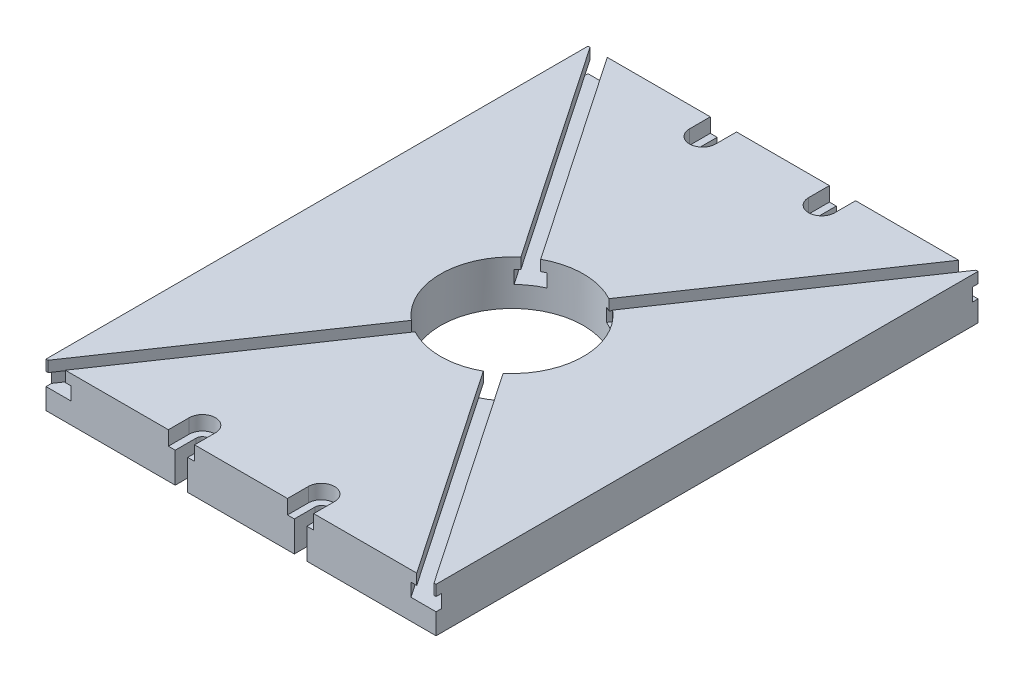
ISO-10303-21;
HEADER;
FILE_DESCRIPTION(('STEP AP214'),'2;1');
FILE_NAME('part.step','',(''),(''),'','','');
FILE_SCHEMA(('AUTOMOTIVE_DESIGN { 1 0 10303 214 1 1 1 1 }'));
ENDSEC;
DATA;
#1=APPLICATION_CONTEXT('core data for automotive mechanical design processes');
#2=APPLICATION_PROTOCOL_DEFINITION('international standard','automotive_design',2000,#1);
#3=PRODUCT_CONTEXT('',#1,'mechanical');
#4=PRODUCT('Part','Part','',(#3));
#5=PRODUCT_RELATED_PRODUCT_CATEGORY('part','',(#4));
#6=PRODUCT_DEFINITION_FORMATION('','',#4);
#7=PRODUCT_DEFINITION_CONTEXT('part definition',#1,'design');
#8=PRODUCT_DEFINITION('design','',#6,#7);
#9=PRODUCT_DEFINITION_SHAPE('','',#8);
#10=(LENGTH_UNIT() NAMED_UNIT(*) SI_UNIT(.MILLI.,.METRE.));
#11=(NAMED_UNIT(*) PLANE_ANGLE_UNIT() SI_UNIT($,.RADIAN.));
#12=(NAMED_UNIT(*) SI_UNIT($,.STERADIAN.) SOLID_ANGLE_UNIT());
#13=UNCERTAINTY_MEASURE_WITH_UNIT(LENGTH_MEASURE(1.E-05),#10,'distance_accuracy_value','');
#14=(GEOMETRIC_REPRESENTATION_CONTEXT(3) GLOBAL_UNCERTAINTY_ASSIGNED_CONTEXT((#13)) GLOBAL_UNIT_ASSIGNED_CONTEXT((#10,
#11,#12)) REPRESENTATION_CONTEXT('',''));
#15=CARTESIAN_POINT('',(0.,0.,0.));
#16=DIRECTION('',(0.,0.,1.));
#17=DIRECTION('',(1.,0.,0.));
#18=AXIS2_PLACEMENT_3D('',#15,#16,#17);
#19=CARTESIAN_POINT('',(0.,57.,0.));
#20=DIRECTION('',(0.,1.,0.));
#21=DIRECTION('',(0.,0.,1.));
#22=AXIS2_PLACEMENT_3D('',#19,#20,#21);
#23=PLANE('',#22);
#24=DIRECTION('',(-0.562450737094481,0.,-0.826830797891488));
#25=VECTOR('',#24,1.);
#26=CARTESIAN_POINT('',(-304.182555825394,57.,-468.498817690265));
#27=LINE('',#26,#25);
#28=CARTESIAN_POINT('',(324.026494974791,57.,455.));
#29=VERTEX_POINT('',#28);
#30=CARTESIAN_POINT('',(77.0777396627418,57.,91.9729419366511));
#31=VERTEX_POINT('',#30);
#32=EDGE_CURVE('E588',#29,#31,#27,.T.);
#33=ORIENTED_EDGE('',*,*,#32,.T.);
#34=CARTESIAN_POINT('',(0.,57.,0.));
#35=DIRECTION('',(0.,1.,0.));
#36=DIRECTION('',(0.,0.,1.));
#37=AXIS2_PLACEMENT_3D('',#34,#35,#36);
#38=CIRCLE('',#37,120.);
#39=CARTESIAN_POINT('',(83.0866846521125,57.,86.5829246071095));
#40=VERTEX_POINT('',#39);
#41=EDGE_CURVE('E1017',#40,#31,#38,.F.);
#42=ORIENTED_EDGE('',*,*,#41,.F.);
#43=DIRECTION('',(-0.562450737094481,0.,-0.826830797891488));
#44=VECTOR('',#43,1.);
#45=CARTESIAN_POINT('',(-300.62876138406,57.,-477.498029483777));
#46=LINE('',#45,#44);
#47=CARTESIAN_POINT('',(327.5,57.,445.882758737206));
#48=VERTEX_POINT('',#47);
#49=EDGE_CURVE('E548',#48,#40,#46,.T.);
#50=ORIENTED_EDGE('',*,*,#49,.F.);
#51=DIRECTION('',(0.,0.,-1.));
#52=VECTOR('',#51,1.);
#53=CARTESIAN_POINT('',(327.5,57.,-455.));
#54=LINE('',#53,#52);
#55=CARTESIAN_POINT('',(327.5,57.,455.));
#56=VERTEX_POINT('',#55);
#57=EDGE_CURVE('E559',#56,#48,#54,.T.);
#58=ORIENTED_EDGE('',*,*,#57,.F.);
#59=DIRECTION('',(1.,0.,0.));
#60=VECTOR('',#59,1.);
#61=CARTESIAN_POINT('',(-327.5,57.,455.));
#62=LINE('',#61,#60);
#63=EDGE_CURVE('E560',#29,#56,#62,.T.);
#64=ORIENTED_EDGE('',*,*,#63,.F.);
#65=EDGE_LOOP('',(#33,#42,#50,#58,#64));
#66=FACE_BOUND('',#65,.T.);
#67=ADVANCED_FACE('F36',(#66),#23,.F.);
#68=DIRECTION('',(0.562450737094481,0.,-0.826830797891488));
#69=VECTOR('',#68,1.);
#70=CARTESIAN_POINT('',(304.182555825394,57.,-468.498817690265));
#71=LINE('',#70,#69);
#72=CARTESIAN_POINT('',(57.2338005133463,57.,-105.471759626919));
#73=VERTEX_POINT('',#72);
#74=CARTESIAN_POINT('',(295.,57.,-455.));
#75=VERTEX_POINT('',#74);
#76=EDGE_CURVE('E503',#73,#75,#71,.T.);
#77=ORIENTED_EDGE('',*,*,#76,.F.);
#78=CARTESIAN_POINT('',(0.,57.,0.));
#79=DIRECTION('',(0.,1.,0.));
#80=DIRECTION('',(0.,0.,1.));
#81=AXIS2_PLACEMENT_3D('',#78,#79,#80);
#82=CIRCLE('',#81,120.);
#83=CARTESIAN_POINT('',(50.013452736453,57.,-109.080954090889));
#84=VERTEX_POINT('',#83);
#85=EDGE_CURVE('E484',#84,#73,#82,.F.);
#86=ORIENTED_EDGE('',*,*,#85,.F.);
#87=DIRECTION('',(0.562450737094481,0.,-0.826830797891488));
#88=VECTOR('',#87,1.);
#89=CARTESIAN_POINT('',(300.62876138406,57.,-477.498029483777));
#90=LINE('',#89,#88);
#91=CARTESIAN_POINT('',(285.324501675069,57.,-455.));
#92=VERTEX_POINT('',#91);
#93=EDGE_CURVE('E1028',#84,#92,#90,.T.);
#94=ORIENTED_EDGE('',*,*,#93,.T.);
#95=DIRECTION('',(-1.,0.,0.));
#96=VECTOR('',#95,1.);
#97=CARTESIAN_POINT('',(-327.5,57.,-455.));
#98=LINE('',#97,#96);
#99=EDGE_CURVE('E510',#75,#92,#98,.T.);
#100=ORIENTED_EDGE('',*,*,#99,.F.);
#101=EDGE_LOOP('',(#77,#86,#94,#100));
#102=FACE_BOUND('',#101,.T.);
#103=ADVANCED_FACE('F508',(#102),#23,.F.);
#104=DIRECTION('',(0.562450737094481,0.,0.826830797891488));
#105=VECTOR('',#104,1.);
#106=CARTESIAN_POINT('',(-333.70199329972,57.,-454.999999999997));
#107=LINE('',#106,#105);
#108=CARTESIAN_POINT('',(50.0134527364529,57.,109.080954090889));
#109=VERTEX_POINT('',#108);
#110=CARTESIAN_POINT('',(285.324501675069,57.,455.));
#111=VERTEX_POINT('',#110);
#112=EDGE_CURVE('E538',#109,#111,#107,.T.);
#113=ORIENTED_EDGE('',*,*,#112,.F.);
#114=CARTESIAN_POINT('',(0.,57.,0.));
#115=DIRECTION('',(0.,1.,0.));
#116=DIRECTION('',(0.,0.,1.));
#117=AXIS2_PLACEMENT_3D('',#114,#115,#116);
#118=CIRCLE('',#117,120.);
#119=CARTESIAN_POINT('',(57.2338005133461,57.,105.471759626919));
#120=VERTEX_POINT('',#119);
#121=EDGE_CURVE('E1006',#120,#109,#118,.F.);
#122=ORIENTED_EDGE('',*,*,#121,.F.);
#123=DIRECTION('',(0.562450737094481,0.,0.826830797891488));
#124=VECTOR('',#123,1.);
#125=CARTESIAN_POINT('',(-324.026494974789,57.,-454.999999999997));
#126=LINE('',#125,#124);
#127=CARTESIAN_POINT('',(295.,57.,455.));
#128=VERTEX_POINT('',#127);
#129=EDGE_CURVE('E587',#120,#128,#126,.T.);
#130=ORIENTED_EDGE('',*,*,#129,.T.);
#131=EDGE_CURVE('E555',#111,#128,#62,.T.);
#132=ORIENTED_EDGE('',*,*,#131,.F.);
#133=EDGE_LOOP('',(#113,#122,#130,#132));
#134=FACE_BOUND('',#133,.T.);
#135=ADVANCED_FACE('F1237',(#134),#23,.F.);
#136=CARTESIAN_POINT('',(-324.026494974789,57.,-454.999999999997));
#137=VERTEX_POINT('',#136);
#138=CARTESIAN_POINT('',(-77.0777396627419,57.,-91.972941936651));
#139=VERTEX_POINT('',#138);
#140=EDGE_CURVE('E583',#137,#139,#126,.T.);
#141=ORIENTED_EDGE('',*,*,#140,.T.);
#142=CARTESIAN_POINT('',(0.,57.,0.));
#143=DIRECTION('',(0.,1.,0.));
#144=DIRECTION('',(0.,0.,1.));
#145=AXIS2_PLACEMENT_3D('',#142,#143,#144);
#146=CIRCLE('',#145,120.);
#147=CARTESIAN_POINT('',(-83.0866846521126,57.,-86.5829246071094));
#148=VERTEX_POINT('',#147);
#149=EDGE_CURVE('E1010',#148,#139,#146,.F.);
#150=ORIENTED_EDGE('',*,*,#149,.F.);
#151=CARTESIAN_POINT('',(-327.5,57.,-445.882758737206));
#152=VERTEX_POINT('',#151);
#153=EDGE_CURVE('E544',#152,#148,#107,.T.);
#154=ORIENTED_EDGE('',*,*,#153,.F.);
#155=DIRECTION('',(0.,0.,1.));
#156=VECTOR('',#155,1.);
#157=CARTESIAN_POINT('',(-327.5,57.,-455.));
#158=LINE('',#157,#156);
#159=CARTESIAN_POINT('',(-327.5,57.,-455.));
#160=VERTEX_POINT('',#159);
#161=EDGE_CURVE('E563',#160,#152,#158,.T.);
#162=ORIENTED_EDGE('',*,*,#161,.F.);
#163=DIRECTION('',(-1.,0.,0.));
#164=VECTOR('',#163,1.);
#165=CARTESIAN_POINT('',(-327.5,57.,-455.));
#166=LINE('',#165,#164);
#167=EDGE_CURVE('E554',#137,#160,#166,.T.);
#168=ORIENTED_EDGE('',*,*,#167,.F.);
#169=EDGE_LOOP('',(#141,#150,#154,#162,#168));
#170=FACE_BOUND('',#169,.T.);
#171=ADVANCED_FACE('F1107',(#170),#23,.F.);
#172=CARTESIAN_POINT('',(0.,35.,0.));
#173=DIRECTION('',(0.,1.,0.));
#174=DIRECTION('',(0.,0.,1.));
#175=AXIS2_PLACEMENT_3D('',#172,#173,#174);
#176=PLANE('',#175);
#177=CARTESIAN_POINT('',(0.,35.,0.));
#178=DIRECTION('',(0.,1.,0.));
#179=DIRECTION('',(0.,0.,1.));
#180=AXIS2_PLACEMENT_3D('',#177,#178,#179);
#181=CIRCLE('',#180,120.);
#182=CARTESIAN_POINT('',(83.0866846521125,35.,86.5829246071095));
#183=VERTEX_POINT('',#182);
#184=CARTESIAN_POINT('',(50.0134527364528,35.,109.080954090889));
#185=VERTEX_POINT('',#184);
#186=EDGE_CURVE('E1016',#183,#185,#181,.F.);
#187=ORIENTED_EDGE('',*,*,#186,.T.);
#188=DIRECTION('',(-0.562450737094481,0.,-0.826830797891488));
#189=VECTOR('',#188,1.);
#190=CARTESIAN_POINT('',(-333.70199329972,34.9999999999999,-454.999999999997));
#191=LINE('',#190,#189);
#192=CARTESIAN_POINT('',(285.324501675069,35.,455.));
#193=VERTEX_POINT('',#192);
#194=EDGE_CURVE('E551',#193,#185,#191,.T.);
#195=ORIENTED_EDGE('',*,*,#194,.F.);
#196=DIRECTION('',(1.,0.,0.));
#197=VECTOR('',#196,1.);
#198=CARTESIAN_POINT('',(-327.5,35.,455.));
#199=LINE('',#198,#197);
#200=CARTESIAN_POINT('',(327.5,35.,455.));
#201=VERTEX_POINT('',#200);
#202=EDGE_CURVE('E884',#193,#201,#199,.T.);
#203=ORIENTED_EDGE('',*,*,#202,.T.);
#204=DIRECTION('',(0.,0.,-1.));
#205=VECTOR('',#204,1.);
#206=CARTESIAN_POINT('',(327.5,35.,-455.));
#207=LINE('',#206,#205);
#208=CARTESIAN_POINT('',(327.5,35.,445.882758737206));
#209=VERTEX_POINT('',#208);
#210=EDGE_CURVE('E568',#201,#209,#207,.T.);
#211=ORIENTED_EDGE('',*,*,#210,.T.);
#212=DIRECTION('',(0.562450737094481,0.,0.826830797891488));
#213=VECTOR('',#212,1.);
#214=CARTESIAN_POINT('',(-300.62876138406,34.9999999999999,-477.498029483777));
#215=LINE('',#214,#213);
#216=EDGE_CURVE('E543',#183,#209,#215,.T.);
#217=ORIENTED_EDGE('',*,*,#216,.F.);
#218=EDGE_LOOP('',(#187,#195,#203,#211,#217));
#219=FACE_BOUND('',#218,.T.);
#220=ADVANCED_FACE('F1649',(#219),#176,.T.);
#221=CARTESIAN_POINT('',(50.0134527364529,34.9999999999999,-109.080954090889));
#222=VERTEX_POINT('',#221);
#223=CARTESIAN_POINT('',(83.0866846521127,34.9999999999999,-86.5829246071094));
#224=VERTEX_POINT('',#223);
#225=EDGE_CURVE('E496',#222,#224,#181,.F.);
#226=ORIENTED_EDGE('',*,*,#225,.T.);
#227=DIRECTION('',(0.562450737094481,0.,-0.826830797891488));
#228=VECTOR('',#227,1.);
#229=CARTESIAN_POINT('',(333.70199329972,34.9999999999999,-454.999999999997));
#230=LINE('',#229,#228);
#231=CARTESIAN_POINT('',(327.5,35.,-445.882758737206));
#232=VERTEX_POINT('',#231);
#233=EDGE_CURVE('E927',#224,#232,#230,.T.);
#234=ORIENTED_EDGE('',*,*,#233,.T.);
#235=DIRECTION('',(0.,0.,-1.));
#236=VECTOR('',#235,1.);
#237=CARTESIAN_POINT('',(327.5,35.,-455.));
#238=LINE('',#237,#236);
#239=CARTESIAN_POINT('',(327.5,35.,-455.));
#240=VERTEX_POINT('',#239);
#241=EDGE_CURVE('E954',#232,#240,#238,.T.);
#242=ORIENTED_EDGE('',*,*,#241,.T.);
#243=DIRECTION('',(-1.,0.,0.));
#244=VECTOR('',#243,1.);
#245=CARTESIAN_POINT('',(-327.5,35.,-455.));
#246=LINE('',#245,#244);
#247=CARTESIAN_POINT('',(285.324501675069,35.,-455.));
#248=VERTEX_POINT('',#247);
#249=EDGE_CURVE('E522',#240,#248,#246,.T.);
#250=ORIENTED_EDGE('',*,*,#249,.T.);
#251=DIRECTION('',(-0.562450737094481,0.,0.826830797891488));
#252=VECTOR('',#251,1.);
#253=CARTESIAN_POINT('',(300.62876138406,34.9999999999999,-477.498029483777));
#254=LINE('',#253,#252);
#255=EDGE_CURVE('E1030',#248,#222,#254,.T.);
#256=ORIENTED_EDGE('',*,*,#255,.T.);
#257=EDGE_LOOP('',(#226,#234,#242,#250,#256));
#258=FACE_BOUND('',#257,.T.);
#259=ADVANCED_FACE('F1696',(#258),#176,.T.);
#260=CARTESIAN_POINT('',(-83.0866846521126,35.,-86.5829246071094));
#261=VERTEX_POINT('',#260);
#262=CARTESIAN_POINT('',(-50.013452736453,35.,-109.080954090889));
#263=VERTEX_POINT('',#262);
#264=EDGE_CURVE('E1003',#261,#263,#181,.F.);
#265=ORIENTED_EDGE('',*,*,#264,.T.);
#266=CARTESIAN_POINT('',(-285.324501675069,35.,-455.));
#267=VERTEX_POINT('',#266);
#268=EDGE_CURVE('E539',#267,#263,#215,.T.);
#269=ORIENTED_EDGE('',*,*,#268,.F.);
#270=DIRECTION('',(-1.,0.,0.));
#271=VECTOR('',#270,1.);
#272=CARTESIAN_POINT('',(-327.5,35.,-455.));
#273=LINE('',#272,#271);
#274=CARTESIAN_POINT('',(-327.5,35.,-455.));
#275=VERTEX_POINT('',#274);
#276=EDGE_CURVE('E574',#267,#275,#273,.T.);
#277=ORIENTED_EDGE('',*,*,#276,.T.);
#278=DIRECTION('',(0.,0.,1.));
#279=VECTOR('',#278,1.);
#280=CARTESIAN_POINT('',(-327.5,35.,-455.));
#281=LINE('',#280,#279);
#282=CARTESIAN_POINT('',(-327.5,35.,-445.882758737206));
#283=VERTEX_POINT('',#282);
#284=EDGE_CURVE('E571',#275,#283,#281,.T.);
#285=ORIENTED_EDGE('',*,*,#284,.T.);
#286=EDGE_CURVE('E542',#261,#283,#191,.T.);
#287=ORIENTED_EDGE('',*,*,#286,.F.);
#288=EDGE_LOOP('',(#265,#269,#277,#285,#287));
#289=FACE_BOUND('',#288,.T.);
#290=ADVANCED_FACE('F1092',(#289),#176,.T.);
#291=CARTESIAN_POINT('',(-327.5,75.,455.));
#292=DIRECTION('',(0.,0.,-1.));
#293=DIRECTION('',(-1.,0.,0.));
#294=AXIS2_PLACEMENT_3D('',#291,#292,#293);
#295=PLANE('',#294);
#296=DIRECTION('',(0.,-1.,0.));
#297=VECTOR('',#296,1.);
#298=CARTESIAN_POINT('',(-327.5,75.,455.));
#299=LINE('',#298,#297);
#300=CARTESIAN_POINT('',(-327.5,75.,455.));
#301=VERTEX_POINT('',#300);
#302=CARTESIAN_POINT('',(-327.5,57.,455.));
#303=VERTEX_POINT('',#302);
#304=EDGE_CURVE('E863',#301,#303,#299,.T.);
#305=ORIENTED_EDGE('',*,*,#304,.T.);
#306=DIRECTION('',(1.,0.,0.));
#307=VECTOR('',#306,1.);
#308=CARTESIAN_POINT('',(-327.5,57.,455.));
#309=LINE('',#308,#307);
#310=CARTESIAN_POINT('',(-324.026494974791,57.,455.));
#311=VERTEX_POINT('',#310);
#312=EDGE_CURVE('E902',#303,#311,#309,.T.);
#313=ORIENTED_EDGE('',*,*,#312,.T.);
#314=DIRECTION('',(0.,1.,0.));
#315=VECTOR('',#314,1.);
#316=CARTESIAN_POINT('',(-324.026494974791,57.,455.));
#317=LINE('',#316,#315);
#318=CARTESIAN_POINT('',(-324.026494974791,75.,455.));
#319=VERTEX_POINT('',#318);
#320=EDGE_CURVE('E516',#311,#319,#317,.T.);
#321=ORIENTED_EDGE('',*,*,#320,.T.);
#322=DIRECTION('',(1.,0.,0.));
#323=VECTOR('',#322,1.);
#324=CARTESIAN_POINT('',(-327.5,75.,455.));
#325=LINE('',#324,#323);
#326=EDGE_CURVE('E839',#301,#319,#325,.T.);
#327=ORIENTED_EDGE('',*,*,#326,.F.);
#328=EDGE_LOOP('',(#305,#313,#321,#327));
#329=FACE_BOUND('',#328,.T.);
#330=ADVANCED_FACE('F906',(#329),#295,.F.);
#331=CARTESIAN_POINT('',(-327.5,75.,-455.));
#332=DIRECTION('',(0.,0.,1.));
#333=DIRECTION('',(1.,0.,0.));
#334=AXIS2_PLACEMENT_3D('',#331,#332,#333);
#335=PLANE('',#334);
#336=DIRECTION('',(0.,-1.,0.));
#337=VECTOR('',#336,1.);
#338=CARTESIAN_POINT('',(327.5,75.,-455.));
#339=LINE('',#338,#337);
#340=CARTESIAN_POINT('',(327.5,75.,-455.));
#341=VERTEX_POINT('',#340);
#342=CARTESIAN_POINT('',(327.5,57.,-455.));
#343=VERTEX_POINT('',#342);
#344=EDGE_CURVE('E871',#341,#343,#339,.T.);
#345=ORIENTED_EDGE('',*,*,#344,.T.);
#346=CARTESIAN_POINT('',(324.026494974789,57.,-454.999999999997));
#347=VERTEX_POINT('',#346);
#348=EDGE_CURVE('E914',#343,#347,#98,.T.);
#349=ORIENTED_EDGE('',*,*,#348,.T.);
#350=DIRECTION('',(0.,1.,0.));
#351=VECTOR('',#350,1.);
#352=CARTESIAN_POINT('',(324.026494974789,57.,-454.999999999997));
#353=LINE('',#352,#351);
#354=CARTESIAN_POINT('',(324.026494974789,75.,-454.999999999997));
#355=VERTEX_POINT('',#354);
#356=EDGE_CURVE('E528',#347,#355,#353,.T.);
#357=ORIENTED_EDGE('',*,*,#356,.T.);
#358=DIRECTION('',(-1.,0.,0.));
#359=VECTOR('',#358,1.);
#360=CARTESIAN_POINT('',(-327.5,75.,-455.));
#361=LINE('',#360,#359);
#362=EDGE_CURVE('E831',#341,#355,#361,.T.);
#363=ORIENTED_EDGE('',*,*,#362,.F.);
#364=EDGE_LOOP('',(#345,#349,#357,#363));
#365=FACE_BOUND('',#364,.T.);
#366=ADVANCED_FACE('F1123',(#365),#335,.F.);
#367=CARTESIAN_POINT('',(-300.62876138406,-1170.09465451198,-477.498029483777));
#368=DIRECTION('',(0.826830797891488,0.,-0.562450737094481));
#369=DIRECTION('',(-0.562450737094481,0.,-0.826830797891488));
#370=AXIS2_PLACEMENT_3D('',#367,#368,#369);
#371=PLANE('',#370);
#372=ORIENTED_EDGE('',*,*,#268,.T.);
#373=DIRECTION('',(0.,1.,0.));
#374=VECTOR('',#373,1.);
#375=CARTESIAN_POINT('',(-50.013452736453,-0.001000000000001,-109.080954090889));
#376=LINE('',#375,#374);
#377=CARTESIAN_POINT('',(-50.013452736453,57.,-109.080954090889));
#378=VERTEX_POINT('',#377);
#379=EDGE_CURVE('E1024',#378,#263,#376,.F.);
#380=ORIENTED_EDGE('',*,*,#379,.F.);
#381=CARTESIAN_POINT('',(-285.324501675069,57.,-455.));
#382=VERTEX_POINT('',#381);
#383=EDGE_CURVE('E547',#378,#382,#46,.T.);
#384=ORIENTED_EDGE('',*,*,#383,.T.);
#385=DIRECTION('',(0.,1.,0.));
#386=VECTOR('',#385,1.);
#387=CARTESIAN_POINT('',(-285.324501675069,75.,-455.));
#388=LINE('',#387,#386);
#389=EDGE_CURVE('E889',#267,#382,#388,.T.);
#390=ORIENTED_EDGE('',*,*,#389,.F.);
#391=EDGE_LOOP('',(#372,#380,#384,#390));
#392=FACE_BOUND('',#391,.T.);
#393=ADVANCED_FACE('F1095',(#392),#371,.F.);
#394=ORIENTED_EDGE('',*,*,#49,.T.);
#395=DIRECTION('',(0.,1.,0.));
#396=VECTOR('',#395,1.);
#397=CARTESIAN_POINT('',(83.0866846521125,-0.001000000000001,86.5829246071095));
#398=LINE('',#397,#396);
#399=EDGE_CURVE('E1020',#183,#40,#398,.T.);
#400=ORIENTED_EDGE('',*,*,#399,.F.);
#401=ORIENTED_EDGE('',*,*,#216,.T.);
#402=DIRECTION('',(0.,-1.,0.));
#403=VECTOR('',#402,1.);
#404=CARTESIAN_POINT('',(327.5,75.,445.882758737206));
#405=LINE('',#404,#403);
#406=EDGE_CURVE('E579',#48,#209,#405,.T.);
#407=ORIENTED_EDGE('',*,*,#406,.F.);
#408=EDGE_LOOP('',(#394,#400,#401,#407));
#409=FACE_BOUND('',#408,.T.);
#410=ADVANCED_FACE('F1317',(#409),#371,.F.);
#411=CARTESIAN_POINT('',(-333.70199329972,-1170.09465451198,-454.999999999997));
#412=DIRECTION('',(-0.826830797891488,0.,0.562450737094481));
#413=DIRECTION('',(0.562450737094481,0.,0.826830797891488));
#414=AXIS2_PLACEMENT_3D('',#411,#412,#413);
#415=PLANE('',#414);
#416=ORIENTED_EDGE('',*,*,#153,.T.);
#417=DIRECTION('',(0.,1.,0.));
#418=VECTOR('',#417,1.);
#419=CARTESIAN_POINT('',(-83.0866846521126,-0.001000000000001,-86.5829246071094));
#420=LINE('',#419,#418);
#421=EDGE_CURVE('E1022',#261,#148,#420,.T.);
#422=ORIENTED_EDGE('',*,*,#421,.F.);
#423=ORIENTED_EDGE('',*,*,#286,.T.);
#424=DIRECTION('',(0.,-1.,0.));
#425=VECTOR('',#424,1.);
#426=CARTESIAN_POINT('',(-327.5,75.,-445.882758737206));
#427=LINE('',#426,#425);
#428=EDGE_CURVE('E576',#152,#283,#427,.T.);
#429=ORIENTED_EDGE('',*,*,#428,.F.);
#430=EDGE_LOOP('',(#416,#422,#423,#429));
#431=FACE_BOUND('',#430,.T.);
#432=ADVANCED_FACE('F1305',(#431),#415,.F.);
#433=ORIENTED_EDGE('',*,*,#194,.T.);
#434=DIRECTION('',(0.,1.,0.));
#435=VECTOR('',#434,1.);
#436=CARTESIAN_POINT('',(50.0134527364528,-0.001000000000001,109.080954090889));
#437=LINE('',#436,#435);
#438=EDGE_CURVE('E1018',#109,#185,#437,.F.);
#439=ORIENTED_EDGE('',*,*,#438,.F.);
#440=ORIENTED_EDGE('',*,*,#112,.T.);
#441=DIRECTION('',(0.,1.,0.));
#442=VECTOR('',#441,1.);
#443=CARTESIAN_POINT('',(285.324501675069,75.,455.));
#444=LINE('',#443,#442);
#445=EDGE_CURVE('E886',#193,#111,#444,.T.);
#446=ORIENTED_EDGE('',*,*,#445,.F.);
#447=EDGE_LOOP('',(#433,#439,#440,#446));
#448=FACE_BOUND('',#447,.T.);
#449=ADVANCED_FACE('F1300',(#448),#415,.F.);
#450=CARTESIAN_POINT('',(0.,75.,0.));
#451=DIRECTION('',(0.,1.,0.));
#452=DIRECTION('',(0.,0.,1.));
#453=AXIS2_PLACEMENT_3D('',#450,#451,#452);
#454=PLANE('',#453);
#455=CARTESIAN_POINT('',(0.,75.,0.));
#456=DIRECTION('',(0.,1.,0.));
#457=DIRECTION('',(0.,0.,1.));
#458=AXIS2_PLACEMENT_3D('',#455,#456,#457);
#459=CIRCLE('',#458,120.);
#460=CARTESIAN_POINT('',(77.0777396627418,75.,91.972941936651));
#461=VERTEX_POINT('',#460);
#462=CARTESIAN_POINT('',(77.077739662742,75.,-91.9729419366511));
#463=VERTEX_POINT('',#462);
#464=EDGE_CURVE('E998',#461,#463,#459,.T.);
#465=ORIENTED_EDGE('',*,*,#464,.F.);
#466=DIRECTION('',(-0.562450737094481,0.,-0.826830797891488));
#467=VECTOR('',#466,1.);
#468=CARTESIAN_POINT('',(-304.182555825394,75.,-468.498817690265));
#469=LINE('',#468,#467);
#470=CARTESIAN_POINT('',(324.026494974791,75.,455.));
#471=VERTEX_POINT('',#470);
#472=EDGE_CURVE('E594',#471,#461,#469,.T.);
#473=ORIENTED_EDGE('',*,*,#472,.F.);
#474=CARTESIAN_POINT('',(327.5,75.,455.));
#475=VERTEX_POINT('',#474);
#476=EDGE_CURVE('E838',#471,#475,#325,.T.);
#477=ORIENTED_EDGE('',*,*,#476,.T.);
#478=DIRECTION('',(0.,0.,-1.));
#479=VECTOR('',#478,1.);
#480=CARTESIAN_POINT('',(327.5,75.,-455.));
#481=LINE('',#480,#479);
#482=EDGE_CURVE('E826',#475,#341,#481,.T.);
#483=ORIENTED_EDGE('',*,*,#482,.T.);
#484=ORIENTED_EDGE('',*,*,#362,.T.);
#485=DIRECTION('',(-0.562450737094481,0.,0.826830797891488));
#486=VECTOR('',#485,1.);
#487=CARTESIAN_POINT('',(324.026494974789,75.,-454.999999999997));
#488=LINE('',#487,#486);
#489=EDGE_CURVE('E513',#355,#463,#488,.T.);
#490=ORIENTED_EDGE('',*,*,#489,.T.);
#491=EDGE_LOOP('',(#465,#473,#477,#483,#484,#490));
#492=FACE_BOUND('',#491,.T.);
#493=ADVANCED_FACE('F1121',(#492),#454,.T.);
#494=CARTESIAN_POINT('',(57.2338005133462,75.,-105.471759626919));
#495=VERTEX_POINT('',#494);
#496=CARTESIAN_POINT('',(-57.2338005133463,75.,-105.471759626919));
#497=VERTEX_POINT('',#496);
#498=EDGE_CURVE('E964',#495,#497,#459,.T.);
#499=ORIENTED_EDGE('',*,*,#498,.F.);
#500=DIRECTION('',(0.562450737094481,0.,-0.826830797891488));
#501=VECTOR('',#500,1.);
#502=CARTESIAN_POINT('',(304.182555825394,75.,-468.498817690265));
#503=LINE('',#502,#501);
#504=CARTESIAN_POINT('',(295.,75.,-455.));
#505=VERTEX_POINT('',#504);
#506=EDGE_CURVE('E505',#495,#505,#503,.T.);
#507=ORIENTED_EDGE('',*,*,#506,.T.);
#508=CARTESIAN_POINT('',(122.,75.,-455.));
#509=VERTEX_POINT('',#508);
#510=EDGE_CURVE('E835',#505,#509,#361,.T.);
#511=ORIENTED_EDGE('',*,*,#510,.T.);
#512=DIRECTION('',(0.,0.,-1.));
#513=VECTOR('',#512,1.);
#514=CARTESIAN_POINT('',(122.,75.,-490.));
#515=LINE('',#514,#513);
#516=CARTESIAN_POINT('',(122.,75.,-420.));
#517=VERTEX_POINT('',#516);
#518=EDGE_CURVE('E683',#517,#509,#515,.T.);
#519=ORIENTED_EDGE('',*,*,#518,.F.);
#520=CARTESIAN_POINT('',(100.,75.,-420.));
#521=DIRECTION('',(0.,1.,0.));
#522=DIRECTION('',(0.,0.,-1.));
#523=AXIS2_PLACEMENT_3D('',#520,#521,#522);
#524=CIRCLE('',#523,22.);
#525=CARTESIAN_POINT('',(78.,75.,-420.));
#526=VERTEX_POINT('',#525);
#527=EDGE_CURVE('E691',#526,#517,#524,.T.);
#528=ORIENTED_EDGE('',*,*,#527,.F.);
#529=DIRECTION('',(0.,0.,1.));
#530=VECTOR('',#529,1.);
#531=CARTESIAN_POINT('',(78.,75.,-490.));
#532=LINE('',#531,#530);
#533=CARTESIAN_POINT('',(78.,75.,-455.));
#534=VERTEX_POINT('',#533);
#535=EDGE_CURVE('E679',#534,#526,#532,.T.);
#536=ORIENTED_EDGE('',*,*,#535,.F.);
#537=CARTESIAN_POINT('',(-78.,75.,-455.));
#538=VERTEX_POINT('',#537);
#539=EDGE_CURVE('E836',#534,#538,#361,.T.);
#540=ORIENTED_EDGE('',*,*,#539,.T.);
#541=DIRECTION('',(0.,0.,-1.));
#542=VECTOR('',#541,1.);
#543=CARTESIAN_POINT('',(-78.,75.,-490.));
#544=LINE('',#543,#542);
#545=CARTESIAN_POINT('',(-78.,75.,-420.));
#546=VERTEX_POINT('',#545);
#547=EDGE_CURVE('E649',#546,#538,#544,.T.);
#548=ORIENTED_EDGE('',*,*,#547,.F.);
#549=CARTESIAN_POINT('',(-100.,75.,-420.));
#550=DIRECTION('',(0.,1.,0.));
#551=DIRECTION('',(0.,0.,1.));
#552=AXIS2_PLACEMENT_3D('',#549,#550,#551);
#553=CIRCLE('',#552,22.);
#554=CARTESIAN_POINT('',(-122.,75.,-420.));
#555=VERTEX_POINT('',#554);
#556=EDGE_CURVE('E657',#555,#546,#553,.T.);
#557=ORIENTED_EDGE('',*,*,#556,.F.);
#558=DIRECTION('',(0.,0.,1.));
#559=VECTOR('',#558,1.);
#560=CARTESIAN_POINT('',(-122.,75.,-490.));
#561=LINE('',#560,#559);
#562=CARTESIAN_POINT('',(-122.,75.,-455.));
#563=VERTEX_POINT('',#562);
#564=EDGE_CURVE('E645',#563,#555,#561,.T.);
#565=ORIENTED_EDGE('',*,*,#564,.F.);
#566=CARTESIAN_POINT('',(-295.,75.,-455.));
#567=VERTEX_POINT('',#566);
#568=EDGE_CURVE('E967',#563,#567,#361,.T.);
#569=ORIENTED_EDGE('',*,*,#568,.T.);
#570=EDGE_CURVE('E593',#497,#567,#469,.T.);
#571=ORIENTED_EDGE('',*,*,#570,.F.);
#572=EDGE_LOOP('',(#499,#507,#511,#519,#528,#536,#540,#548,#557,#565,#569,#571));
#573=FACE_BOUND('',#572,.T.);
#574=ADVANCED_FACE('F960',(#573),#454,.T.);
#575=DIRECTION('',(0.,1.,0.));
#576=VECTOR('',#575,1.);
#577=CARTESIAN_POINT('',(-295.,75.,455.));
#578=LINE('',#577,#576);
#579=CARTESIAN_POINT('',(-295.,57.,455.));
#580=VERTEX_POINT('',#579);
#581=CARTESIAN_POINT('',(-295.,75.,455.));
#582=VERTEX_POINT('',#581);
#583=EDGE_CURVE('E535',#580,#582,#578,.T.);
#584=ORIENTED_EDGE('',*,*,#583,.F.);
#585=CARTESIAN_POINT('',(-285.32450167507,57.,455.));
#586=VERTEX_POINT('',#585);
#587=EDGE_CURVE('E912',#580,#586,#309,.T.);
#588=ORIENTED_EDGE('',*,*,#587,.T.);
#589=DIRECTION('',(0.,1.,0.));
#590=VECTOR('',#589,1.);
#591=CARTESIAN_POINT('',(-285.324501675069,75.,455.));
#592=LINE('',#591,#590);
#593=CARTESIAN_POINT('',(-285.324501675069,35.,455.));
#594=VERTEX_POINT('',#593);
#595=EDGE_CURVE('E935',#594,#586,#592,.T.);
#596=ORIENTED_EDGE('',*,*,#595,.F.);
#597=DIRECTION('',(1.,0.,0.));
#598=VECTOR('',#597,1.);
#599=CARTESIAN_POINT('',(-327.5,35.,455.));
#600=LINE('',#599,#598);
#601=CARTESIAN_POINT('',(-327.5,35.,455.));
#602=VERTEX_POINT('',#601);
#603=EDGE_CURVE('E953',#602,#594,#600,.T.);
#604=ORIENTED_EDGE('',*,*,#603,.F.);
#605=CARTESIAN_POINT('',(-327.5,0.,455.));
#606=VERTEX_POINT('',#605);
#607=EDGE_CURVE('E862',#602,#606,#299,.T.);
#608=ORIENTED_EDGE('',*,*,#607,.T.);
#609=DIRECTION('',(1.,0.,0.));
#610=VECTOR('',#609,1.);
#611=CARTESIAN_POINT('',(-327.5,0.,455.));
#612=LINE('',#611,#610);
#613=CARTESIAN_POINT('',(-110.5,0.,455.));
#614=VERTEX_POINT('',#613);
#615=EDGE_CURVE('E830',#606,#614,#612,.T.);
#616=ORIENTED_EDGE('',*,*,#615,.T.);
#617=DIRECTION('',(0.,-1.,0.));
#618=VECTOR('',#617,1.);
#619=CARTESIAN_POINT('',(-110.5,-0.001000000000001,455.));
#620=LINE('',#619,#618);
#621=CARTESIAN_POINT('',(-110.5,51.,455.));
#622=VERTEX_POINT('',#621);
#623=EDGE_CURVE('E756',#622,#614,#620,.T.);
#624=ORIENTED_EDGE('',*,*,#623,.F.);
#625=DIRECTION('',(-1.,0.,0.));
#626=VECTOR('',#625,1.);
#627=CARTESIAN_POINT('',(-327.5,51.,455.));
#628=LINE('',#627,#626);
#629=CARTESIAN_POINT('',(-122.,51.,455.));
#630=VERTEX_POINT('',#629);
#631=EDGE_CURVE('E636',#622,#630,#628,.T.);
#632=ORIENTED_EDGE('',*,*,#631,.T.);
#633=DIRECTION('',(0.,1.,0.));
#634=VECTOR('',#633,1.);
#635=CARTESIAN_POINT('',(-122.,75.,455.));
#636=LINE('',#635,#634);
#637=CARTESIAN_POINT('',(-122.,75.,455.));
#638=VERTEX_POINT('',#637);
#639=EDGE_CURVE('E642',#630,#638,#636,.T.);
#640=ORIENTED_EDGE('',*,*,#639,.T.);
#641=EDGE_CURVE('E843',#582,#638,#325,.T.);
#642=ORIENTED_EDGE('',*,*,#641,.F.);
#643=EDGE_LOOP('',(#584,#588,#596,#604,#608,#616,#624,#632,#640,#642));
#644=FACE_BOUND('',#643,.T.);
#645=ADVANCED_FACE('F1148',(#644),#295,.F.);
#646=DIRECTION('',(0.,1.,0.));
#647=VECTOR('',#646,1.);
#648=CARTESIAN_POINT('',(295.,75.,-455.));
#649=LINE('',#648,#647);
#650=EDGE_CURVE('E531',#75,#505,#649,.T.);
#651=ORIENTED_EDGE('',*,*,#650,.F.);
#652=ORIENTED_EDGE('',*,*,#99,.T.);
#653=DIRECTION('',(0.,1.,0.));
#654=VECTOR('',#653,1.);
#655=CARTESIAN_POINT('',(285.324501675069,75.,-455.));
#656=LINE('',#655,#654);
#657=EDGE_CURVE('E948',#248,#92,#656,.T.);
#658=ORIENTED_EDGE('',*,*,#657,.F.);
#659=ORIENTED_EDGE('',*,*,#249,.F.);
#660=CARTESIAN_POINT('',(327.5,0.,-455.));
#661=VERTEX_POINT('',#660);
#662=EDGE_CURVE('E870',#240,#661,#339,.T.);
#663=ORIENTED_EDGE('',*,*,#662,.T.);
#664=DIRECTION('',(-1.,0.,0.));
#665=VECTOR('',#664,1.);
#666=CARTESIAN_POINT('',(-327.5,0.,-455.));
#667=LINE('',#666,#665);
#668=CARTESIAN_POINT('',(110.5,0.,-455.));
#669=VERTEX_POINT('',#668);
#670=EDGE_CURVE('E848',#661,#669,#667,.T.);
#671=ORIENTED_EDGE('',*,*,#670,.T.);
#672=DIRECTION('',(0.,-1.,0.));
#673=VECTOR('',#672,1.);
#674=CARTESIAN_POINT('',(110.5,-0.001000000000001,-455.));
#675=LINE('',#674,#673);
#676=CARTESIAN_POINT('',(110.5,51.,-455.));
#677=VERTEX_POINT('',#676);
#678=EDGE_CURVE('E792',#677,#669,#675,.T.);
#679=ORIENTED_EDGE('',*,*,#678,.F.);
#680=DIRECTION('',(1.,0.,0.));
#681=VECTOR('',#680,1.);
#682=CARTESIAN_POINT('',(-327.5,51.,-455.));
#683=LINE('',#682,#681);
#684=CARTESIAN_POINT('',(122.,51.,-455.));
#685=VERTEX_POINT('',#684);
#686=EDGE_CURVE('E706',#677,#685,#683,.T.);
#687=ORIENTED_EDGE('',*,*,#686,.T.);
#688=DIRECTION('',(0.,1.,0.));
#689=VECTOR('',#688,1.);
#690=CARTESIAN_POINT('',(122.,75.,-455.));
#691=LINE('',#690,#689);
#692=EDGE_CURVE('E715',#685,#509,#691,.T.);
#693=ORIENTED_EDGE('',*,*,#692,.T.);
#694=ORIENTED_EDGE('',*,*,#510,.F.);
#695=EDGE_LOOP('',(#651,#652,#658,#659,#663,#671,#679,#687,#693,#694));
#696=FACE_BOUND('',#695,.T.);
#697=ADVANCED_FACE('F965',(#696),#335,.F.);
#698=CARTESIAN_POINT('',(-57.233800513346,75.,105.471759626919));
#699=VERTEX_POINT('',#698);
#700=CARTESIAN_POINT('',(57.233800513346,75.,105.471759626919));
#701=VERTEX_POINT('',#700);
#702=EDGE_CURVE('E990',#699,#701,#459,.T.);
#703=ORIENTED_EDGE('',*,*,#702,.F.);
#704=EDGE_CURVE('E519',#699,#582,#488,.T.);
#705=ORIENTED_EDGE('',*,*,#704,.T.);
#706=ORIENTED_EDGE('',*,*,#641,.T.);
#707=DIRECTION('',(0.,0.,1.));
#708=VECTOR('',#707,1.);
#709=CARTESIAN_POINT('',(-122.,75.,490.));
#710=LINE('',#709,#708);
#711=CARTESIAN_POINT('',(-122.,75.,420.));
#712=VERTEX_POINT('',#711);
#713=EDGE_CURVE('E610',#712,#638,#710,.T.);
#714=ORIENTED_EDGE('',*,*,#713,.F.);
#715=CARTESIAN_POINT('',(-100.,75.,420.));
#716=DIRECTION('',(0.,1.,0.));
#717=DIRECTION('',(0.,0.,-1.));
#718=AXIS2_PLACEMENT_3D('',#715,#716,#717);
#719=CIRCLE('',#718,22.);
#720=CARTESIAN_POINT('',(-78.,75.,420.));
#721=VERTEX_POINT('',#720);
#722=EDGE_CURVE('E618',#721,#712,#719,.T.);
#723=ORIENTED_EDGE('',*,*,#722,.F.);
#724=DIRECTION('',(0.,0.,-1.));
#725=VECTOR('',#724,1.);
#726=CARTESIAN_POINT('',(-78.,75.,490.));
#727=LINE('',#726,#725);
#728=CARTESIAN_POINT('',(-78.,75.,455.));
#729=VERTEX_POINT('',#728);
#730=EDGE_CURVE('E606',#729,#721,#727,.T.);
#731=ORIENTED_EDGE('',*,*,#730,.F.);
#732=CARTESIAN_POINT('',(78.,75.,455.));
#733=VERTEX_POINT('',#732);
#734=EDGE_CURVE('E1136',#729,#733,#325,.T.);
#735=ORIENTED_EDGE('',*,*,#734,.T.);
#736=DIRECTION('',(0.,0.,1.));
#737=VECTOR('',#736,1.);
#738=CARTESIAN_POINT('',(78.,75.,490.));
#739=LINE('',#738,#737);
#740=CARTESIAN_POINT('',(78.,75.,420.));
#741=VERTEX_POINT('',#740);
#742=EDGE_CURVE('E722',#741,#733,#739,.T.);
#743=ORIENTED_EDGE('',*,*,#742,.F.);
#744=CARTESIAN_POINT('',(100.,75.,420.));
#745=DIRECTION('',(0.,1.,0.));
#746=DIRECTION('',(0.,0.,1.));
#747=AXIS2_PLACEMENT_3D('',#744,#745,#746);
#748=CIRCLE('',#747,22.);
#749=CARTESIAN_POINT('',(122.,75.,420.));
#750=VERTEX_POINT('',#749);
#751=EDGE_CURVE('E730',#750,#741,#748,.T.);
#752=ORIENTED_EDGE('',*,*,#751,.F.);
#753=DIRECTION('',(0.,0.,-1.));
#754=VECTOR('',#753,1.);
#755=CARTESIAN_POINT('',(122.,75.,490.));
#756=LINE('',#755,#754);
#757=CARTESIAN_POINT('',(122.,75.,455.));
#758=VERTEX_POINT('',#757);
#759=EDGE_CURVE('E718',#758,#750,#756,.T.);
#760=ORIENTED_EDGE('',*,*,#759,.F.);
#761=CARTESIAN_POINT('',(295.,75.,455.));
#762=VERTEX_POINT('',#761);
#763=EDGE_CURVE('E844',#758,#762,#325,.T.);
#764=ORIENTED_EDGE('',*,*,#763,.T.);
#765=DIRECTION('',(0.562450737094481,0.,0.826830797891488));
#766=VECTOR('',#765,1.);
#767=CARTESIAN_POINT('',(-324.026494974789,75.,-454.999999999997));
#768=LINE('',#767,#766);
#769=EDGE_CURVE('E582',#701,#762,#768,.T.);
#770=ORIENTED_EDGE('',*,*,#769,.F.);
#771=EDGE_LOOP('',(#703,#705,#706,#714,#723,#731,#735,#743,#752,#760,#764,#770));
#772=FACE_BOUND('',#771,.T.);
#773=ADVANCED_FACE('F1142',(#772),#454,.T.);
#774=CARTESIAN_POINT('',(-77.077739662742,75.,-91.9729419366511));
#775=VERTEX_POINT('',#774);
#776=CARTESIAN_POINT('',(-77.0777396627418,75.,91.972941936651));
#777=VERTEX_POINT('',#776);
#778=EDGE_CURVE('E997',#775,#777,#459,.T.);
#779=ORIENTED_EDGE('',*,*,#778,.F.);
#780=CARTESIAN_POINT('',(-324.026494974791,75.,-455.));
#781=VERTEX_POINT('',#780);
#782=EDGE_CURVE('E591',#781,#775,#768,.T.);
#783=ORIENTED_EDGE('',*,*,#782,.F.);
#784=CARTESIAN_POINT('',(-327.5,75.,-455.));
#785=VERTEX_POINT('',#784);
#786=EDGE_CURVE('E829',#781,#785,#361,.T.);
#787=ORIENTED_EDGE('',*,*,#786,.T.);
#788=DIRECTION('',(0.,0.,1.));
#789=VECTOR('',#788,1.);
#790=CARTESIAN_POINT('',(-327.5,75.,-455.));
#791=LINE('',#790,#789);
#792=EDGE_CURVE('E834',#785,#301,#791,.T.);
#793=ORIENTED_EDGE('',*,*,#792,.T.);
#794=ORIENTED_EDGE('',*,*,#326,.T.);
#795=EDGE_CURVE('E525',#319,#777,#503,.T.);
#796=ORIENTED_EDGE('',*,*,#795,.T.);
#797=EDGE_LOOP('',(#779,#783,#787,#793,#794,#796));
#798=FACE_BOUND('',#797,.T.);
#799=ADVANCED_FACE('F1111',(#798),#454,.T.);
#800=CARTESIAN_POINT('',(-304.182555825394,57.,-468.498817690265));
#801=DIRECTION('',(0.826830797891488,0.,-0.562450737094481));
#802=DIRECTION('',(-0.562450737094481,0.,-0.826830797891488));
#803=AXIS2_PLACEMENT_3D('',#800,#801,#802);
#804=PLANE('',#803);
#805=ORIENTED_EDGE('',*,*,#472,.T.);
#806=DIRECTION('',(0.,1.,0.));
#807=VECTOR('',#806,1.);
#808=CARTESIAN_POINT('',(77.0777396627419,-0.001000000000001,91.972941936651));
#809=LINE('',#808,#807);
#810=EDGE_CURVE('E987',#31,#461,#809,.T.);
#811=ORIENTED_EDGE('',*,*,#810,.F.);
#812=ORIENTED_EDGE('',*,*,#32,.F.);
#813=DIRECTION('',(0.,1.,0.));
#814=VECTOR('',#813,1.);
#815=CARTESIAN_POINT('',(324.026494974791,57.,455.));
#816=LINE('',#815,#814);
#817=EDGE_CURVE('E597',#29,#471,#816,.T.);
#818=ORIENTED_EDGE('',*,*,#817,.T.);
#819=EDGE_LOOP('',(#805,#811,#812,#818));
#820=FACE_BOUND('',#819,.T.);
#821=ADVANCED_FACE('F1135',(#820),#804,.F.);
#822=CARTESIAN_POINT('',(-57.2338005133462,57.,-105.471759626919));
#823=VERTEX_POINT('',#822);
#824=CARTESIAN_POINT('',(-295.,57.,-455.));
#825=VERTEX_POINT('',#824);
#826=EDGE_CURVE('E586',#823,#825,#27,.T.);
#827=ORIENTED_EDGE('',*,*,#826,.F.);
#828=DIRECTION('',(0.,1.,0.));
#829=VECTOR('',#828,1.);
#830=CARTESIAN_POINT('',(-57.2338005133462,-0.001000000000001,-105.471759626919));
#831=LINE('',#830,#829);
#832=EDGE_CURVE('E985',#497,#823,#831,.F.);
#833=ORIENTED_EDGE('',*,*,#832,.F.);
#834=ORIENTED_EDGE('',*,*,#570,.T.);
#835=DIRECTION('',(0.,1.,0.));
#836=VECTOR('',#835,1.);
#837=CARTESIAN_POINT('',(-295.,75.,-455.));
#838=LINE('',#837,#836);
#839=EDGE_CURVE('E603',#825,#567,#838,.T.);
#840=ORIENTED_EDGE('',*,*,#839,.F.);
#841=EDGE_LOOP('',(#827,#833,#834,#840));
#842=FACE_BOUND('',#841,.T.);
#843=ADVANCED_FACE('F983',(#842),#804,.F.);
#844=CARTESIAN_POINT('',(-324.026494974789,57.,-454.999999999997));
#845=DIRECTION('',(-0.826830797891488,0.,0.562450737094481));
#846=DIRECTION('',(0.562450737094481,0.,0.826830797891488));
#847=AXIS2_PLACEMENT_3D('',#844,#845,#846);
#848=PLANE('',#847);
#849=ORIENTED_EDGE('',*,*,#129,.F.);
#850=DIRECTION('',(0.,1.,0.));
#851=VECTOR('',#850,1.);
#852=CARTESIAN_POINT('',(57.2338005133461,-0.001000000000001,105.471759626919));
#853=LINE('',#852,#851);
#854=EDGE_CURVE('E988',#701,#120,#853,.F.);
#855=ORIENTED_EDGE('',*,*,#854,.F.);
#856=ORIENTED_EDGE('',*,*,#769,.T.);
#857=DIRECTION('',(0.,1.,0.));
#858=VECTOR('',#857,1.);
#859=CARTESIAN_POINT('',(295.,75.,455.));
#860=LINE('',#859,#858);
#861=EDGE_CURVE('E599',#128,#762,#860,.T.);
#862=ORIENTED_EDGE('',*,*,#861,.F.);
#863=EDGE_LOOP('',(#849,#855,#856,#862));
#864=FACE_BOUND('',#863,.T.);
#865=ADVANCED_FACE('F1201',(#864),#848,.F.);
#866=ORIENTED_EDGE('',*,*,#782,.T.);
#867=DIRECTION('',(0.,1.,0.));
#868=VECTOR('',#867,1.);
#869=CARTESIAN_POINT('',(-77.0777396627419,-0.001000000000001,-91.972941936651));
#870=LINE('',#869,#868);
#871=EDGE_CURVE('E992',#139,#775,#870,.T.);
#872=ORIENTED_EDGE('',*,*,#871,.F.);
#873=ORIENTED_EDGE('',*,*,#140,.F.);
#874=DIRECTION('',(0.,1.,0.));
#875=VECTOR('',#874,1.);
#876=CARTESIAN_POINT('',(-324.026494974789,57.,-454.999999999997));
#877=LINE('',#876,#875);
#878=EDGE_CURVE('E59',#137,#781,#877,.T.);
#879=ORIENTED_EDGE('',*,*,#878,.T.);
#880=EDGE_LOOP('',(#866,#872,#873,#879));
#881=FACE_BOUND('',#880,.T.);
#882=ADVANCED_FACE('F1106',(#881),#848,.F.);
#883=DIRECTION('',(-0.562450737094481,0.,0.826830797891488));
#884=VECTOR('',#883,1.);
#885=CARTESIAN_POINT('',(333.70199329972,57.,-454.999999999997));
#886=LINE('',#885,#884);
#887=CARTESIAN_POINT('',(327.5,57.,-445.882758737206));
#888=VERTEX_POINT('',#887);
#889=CARTESIAN_POINT('',(83.0866846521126,57.,-86.5829246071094));
#890=VERTEX_POINT('',#889);
#891=EDGE_CURVE('E1034',#888,#890,#886,.T.);
#892=ORIENTED_EDGE('',*,*,#891,.T.);
#893=CARTESIAN_POINT('',(77.077739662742,57.,-91.9729419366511));
#894=VERTEX_POINT('',#893);
#895=EDGE_CURVE('E1014',#894,#890,#38,.F.);
#896=ORIENTED_EDGE('',*,*,#895,.F.);
#897=DIRECTION('',(-0.562450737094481,0.,0.826830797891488));
#898=VECTOR('',#897,1.);
#899=CARTESIAN_POINT('',(324.026494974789,57.,-454.999999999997));
#900=LINE('',#899,#898);
#901=EDGE_CURVE('E512',#347,#894,#900,.T.);
#902=ORIENTED_EDGE('',*,*,#901,.F.);
#903=ORIENTED_EDGE('',*,*,#348,.F.);
#904=DIRECTION('',(0.,0.,-1.));
#905=VECTOR('',#904,1.);
#906=CARTESIAN_POINT('',(327.5,57.,-455.));
#907=LINE('',#906,#905);
#908=EDGE_CURVE('E909',#888,#343,#907,.T.);
#909=ORIENTED_EDGE('',*,*,#908,.F.);
#910=EDGE_LOOP('',(#892,#896,#902,#903,#909));
#911=FACE_BOUND('',#910,.T.);
#912=ADVANCED_FACE('F1041',(#911),#23,.F.);
#913=ORIENTED_EDGE('',*,*,#383,.F.);
#914=EDGE_CURVE('E498',#823,#378,#82,.F.);
#915=ORIENTED_EDGE('',*,*,#914,.F.);
#916=ORIENTED_EDGE('',*,*,#826,.T.);
#917=EDGE_CURVE('E558',#382,#825,#166,.T.);
#918=ORIENTED_EDGE('',*,*,#917,.F.);
#919=EDGE_LOOP('',(#913,#915,#916,#918));
#920=FACE_BOUND('',#919,.T.);
#921=ADVANCED_FACE('F1099',(#920),#23,.F.);
#922=DIRECTION('',(-0.562450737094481,0.,0.826830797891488));
#923=VECTOR('',#922,1.);
#924=CARTESIAN_POINT('',(9.92196957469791,57.,6.74940884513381));
#925=LINE('',#924,#923);
#926=CARTESIAN_POINT('',(-57.2338005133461,57.,105.471759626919));
#927=VERTEX_POINT('',#926);
#928=EDGE_CURVE('E12',#927,#580,#925,.T.);
#929=ORIENTED_EDGE('',*,*,#928,.F.);
#930=CARTESIAN_POINT('',(-50.0134527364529,57.,109.080954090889));
#931=VERTEX_POINT('',#930);
#932=EDGE_CURVE('E1002',#931,#927,#118,.F.);
#933=ORIENTED_EDGE('',*,*,#932,.F.);
#934=EDGE_CURVE('E1033',#931,#586,#886,.T.);
#935=ORIENTED_EDGE('',*,*,#934,.T.);
#936=ORIENTED_EDGE('',*,*,#587,.F.);
#937=EDGE_LOOP('',(#929,#933,#935,#936));
#938=FACE_BOUND('',#937,.T.);
#939=ADVANCED_FACE('F1209',(#938),#23,.F.);
#940=CARTESIAN_POINT('',(-327.5,57.,445.882758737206));
#941=VERTEX_POINT('',#940);
#942=CARTESIAN_POINT('',(-83.0866846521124,57.,86.5829246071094));
#943=VERTEX_POINT('',#942);
#944=EDGE_CURVE('E1032',#941,#943,#90,.T.);
#945=ORIENTED_EDGE('',*,*,#944,.T.);
#946=CARTESIAN_POINT('',(-77.0777396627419,57.,91.9729419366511));
#947=VERTEX_POINT('',#946);
#948=EDGE_CURVE('E904',#947,#943,#146,.F.);
#949=ORIENTED_EDGE('',*,*,#948,.F.);
#950=DIRECTION('',(0.562450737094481,0.,-0.826830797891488));
#951=VECTOR('',#950,1.);
#952=CARTESIAN_POINT('',(-9.92196957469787,57.,-6.74940884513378));
#953=LINE('',#952,#951);
#954=EDGE_CURVE('E44',#311,#947,#953,.T.);
#955=ORIENTED_EDGE('',*,*,#954,.F.);
#956=ORIENTED_EDGE('',*,*,#312,.F.);
#957=DIRECTION('',(0.,0.,1.));
#958=VECTOR('',#957,1.);
#959=CARTESIAN_POINT('',(-327.5,57.,-455.));
#960=LINE('',#959,#958);
#961=EDGE_CURVE('E910',#941,#303,#960,.T.);
#962=ORIENTED_EDGE('',*,*,#961,.F.);
#963=EDGE_LOOP('',(#945,#949,#955,#956,#962));
#964=FACE_BOUND('',#963,.T.);
#965=ADVANCED_FACE('F901',(#964),#23,.F.);
#966=ORIENTED_EDGE('',*,*,#878,.F.);
#967=ORIENTED_EDGE('',*,*,#167,.T.);
#968=DIRECTION('',(0.,-1.,0.));
#969=VECTOR('',#968,1.);
#970=CARTESIAN_POINT('',(-327.5,75.,-455.));
#971=LINE('',#970,#969);
#972=EDGE_CURVE('E867',#785,#160,#971,.T.);
#973=ORIENTED_EDGE('',*,*,#972,.F.);
#974=ORIENTED_EDGE('',*,*,#786,.F.);
#975=EDGE_LOOP('',(#966,#967,#973,#974));
#976=FACE_BOUND('',#975,.T.);
#977=ADVANCED_FACE('F1109',(#976),#335,.F.);
#978=ORIENTED_EDGE('',*,*,#817,.F.);
#979=ORIENTED_EDGE('',*,*,#63,.T.);
#980=DIRECTION('',(0.,-1.,0.));
#981=VECTOR('',#980,1.);
#982=CARTESIAN_POINT('',(327.5,75.,455.));
#983=LINE('',#982,#981);
#984=EDGE_CURVE('E859',#475,#56,#983,.T.);
#985=ORIENTED_EDGE('',*,*,#984,.F.);
#986=ORIENTED_EDGE('',*,*,#476,.F.);
#987=EDGE_LOOP('',(#978,#979,#985,#986));
#988=FACE_BOUND('',#987,.T.);
#989=ADVANCED_FACE('F1129',(#988),#295,.F.);
#990=CARTESIAN_POINT('',(-89.5000000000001,-0.001000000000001,-490.));
#991=DIRECTION('',(1.,0.,0.));
#992=DIRECTION('',(0.,0.,-1.));
#993=AXIS2_PLACEMENT_3D('',#990,#991,#992);
#994=PLANE('',#993);
#995=DIRECTION('',(0.,0.,1.));
#996=VECTOR('',#995,1.);
#997=CARTESIAN_POINT('',(-89.5000000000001,51.,-490.));
#998=LINE('',#997,#996);
#999=CARTESIAN_POINT('',(-89.5000000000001,51.,-455.));
#1000=VERTEX_POINT('',#999);
#1001=CARTESIAN_POINT('',(-89.5000000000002,51.,-420.));
#1002=VERTEX_POINT('',#1001);
#1003=EDGE_CURVE('E667',#1000,#1002,#998,.T.);
#1004=ORIENTED_EDGE('',*,*,#1003,.F.);
#1005=DIRECTION('',(0.,-1.,0.));
#1006=VECTOR('',#1005,1.);
#1007=CARTESIAN_POINT('',(-89.5000000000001,-0.001000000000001,-455.));
#1008=LINE('',#1007,#1006);
#1009=CARTESIAN_POINT('',(-89.5000000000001,0.,-455.));
#1010=VERTEX_POINT('',#1009);
#1011=EDGE_CURVE('E774',#1000,#1010,#1008,.T.);
#1012=ORIENTED_EDGE('',*,*,#1011,.T.);
#1013=DIRECTION('',(0.,0.,1.));
#1014=VECTOR('',#1013,1.);
#1015=CARTESIAN_POINT('',(-89.5000000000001,0.,-490.));
#1016=LINE('',#1015,#1014);
#1017=CARTESIAN_POINT('',(-89.5000000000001,0.,-420.));
#1018=VERTEX_POINT('',#1017);
#1019=EDGE_CURVE('E778',#1010,#1018,#1016,.T.);
#1020=ORIENTED_EDGE('',*,*,#1019,.T.);
#1021=DIRECTION('',(0.,1.,0.));
#1022=VECTOR('',#1021,1.);
#1023=CARTESIAN_POINT('',(-89.5000000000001,-0.001000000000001,-420.));
#1024=LINE('',#1023,#1022);
#1025=EDGE_CURVE('E782',#1018,#1002,#1024,.T.);
#1026=ORIENTED_EDGE('',*,*,#1025,.T.);
#1027=EDGE_LOOP('',(#1004,#1012,#1020,#1026));
#1028=FACE_BOUND('',#1027,.T.);
#1029=ADVANCED_FACE('F1401',(#1028),#994,.F.);
#1030=CARTESIAN_POINT('',(-100.,-0.001000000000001,-420.));
#1031=DIRECTION('',(0.,1.,0.));
#1032=DIRECTION('',(0.,0.,1.));
#1033=AXIS2_PLACEMENT_3D('',#1030,#1031,#1032);
#1034=CYLINDRICAL_SURFACE('',#1033,10.4999999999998);
#1035=CARTESIAN_POINT('',(-100.,51.,-420.));
#1036=DIRECTION('',(0.,1.,0.));
#1037=DIRECTION('',(0.,0.,1.));
#1038=AXIS2_PLACEMENT_3D('',#1035,#1036,#1037);
#1039=CIRCLE('',#1038,10.4999999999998);
#1040=CARTESIAN_POINT('',(-110.5,51.,-420.));
#1041=VERTEX_POINT('',#1040);
#1042=EDGE_CURVE('E663',#1002,#1041,#1039,.F.);
#1043=ORIENTED_EDGE('',*,*,#1042,.F.);
#1044=ORIENTED_EDGE('',*,*,#1025,.F.);
#1045=CARTESIAN_POINT('',(-100.,0.,-420.));
#1046=DIRECTION('',(0.,1.,0.));
#1047=DIRECTION('',(0.,0.,1.));
#1048=AXIS2_PLACEMENT_3D('',#1045,#1046,#1047);
#1049=CIRCLE('',#1048,10.4999999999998);
#1050=CARTESIAN_POINT('',(-110.5,0.,-420.));
#1051=VERTEX_POINT('',#1050);
#1052=EDGE_CURVE('E776',#1018,#1051,#1049,.F.);
#1053=ORIENTED_EDGE('',*,*,#1052,.T.);
#1054=DIRECTION('',(0.,1.,0.));
#1055=VECTOR('',#1054,1.);
#1056=CARTESIAN_POINT('',(-110.5,-0.001000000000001,-420.));
#1057=LINE('',#1056,#1055);
#1058=EDGE_CURVE('E781',#1051,#1041,#1057,.T.);
#1059=ORIENTED_EDGE('',*,*,#1058,.T.);
#1060=EDGE_LOOP('',(#1043,#1044,#1053,#1059));
#1061=FACE_BOUND('',#1060,.T.);
#1062=ADVANCED_FACE('F1581',(#1061),#1034,.F.);
#1063=CARTESIAN_POINT('',(-110.5,-0.001000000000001,-490.));
#1064=DIRECTION('',(-1.,0.,0.));
#1065=DIRECTION('',(0.,0.,1.));
#1066=AXIS2_PLACEMENT_3D('',#1063,#1064,#1065);
#1067=PLANE('',#1066);
#1068=DIRECTION('',(0.,0.,-1.));
#1069=VECTOR('',#1068,1.);
#1070=CARTESIAN_POINT('',(-110.5,51.,-490.));
#1071=LINE('',#1070,#1069);
#1072=CARTESIAN_POINT('',(-110.5,51.,-455.));
#1073=VERTEX_POINT('',#1072);
#1074=EDGE_CURVE('E879',#1041,#1073,#1071,.T.);
#1075=ORIENTED_EDGE('',*,*,#1074,.F.);
#1076=ORIENTED_EDGE('',*,*,#1058,.F.);
#1077=DIRECTION('',(0.,0.,-1.));
#1078=VECTOR('',#1077,1.);
#1079=CARTESIAN_POINT('',(-110.5,0.,-490.));
#1080=LINE('',#1079,#1078);
#1081=CARTESIAN_POINT('',(-110.5,0.,-455.));
#1082=VERTEX_POINT('',#1081);
#1083=EDGE_CURVE('E785',#1051,#1082,#1080,.T.);
#1084=ORIENTED_EDGE('',*,*,#1083,.T.);
#1085=DIRECTION('',(0.,1.,0.));
#1086=VECTOR('',#1085,1.);
#1087=CARTESIAN_POINT('',(-110.5,-0.001000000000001,-455.));
#1088=LINE('',#1087,#1086);
#1089=EDGE_CURVE('E771',#1082,#1073,#1088,.T.);
#1090=ORIENTED_EDGE('',*,*,#1089,.T.);
#1091=EDGE_LOOP('',(#1075,#1076,#1084,#1090));
#1092=FACE_BOUND('',#1091,.T.);
#1093=ADVANCED_FACE('F1573',(#1092),#1067,.F.);
#1094=CARTESIAN_POINT('',(89.5000000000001,-0.001000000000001,490.));
#1095=DIRECTION('',(-1.,0.,0.));
#1096=DIRECTION('',(0.,0.,1.));
#1097=AXIS2_PLACEMENT_3D('',#1094,#1095,#1096);
#1098=PLANE('',#1097);
#1099=DIRECTION('',(0.,0.,-1.));
#1100=VECTOR('',#1099,1.);
#1101=CARTESIAN_POINT('',(89.5000000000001,51.,490.));
#1102=LINE('',#1101,#1100);
#1103=CARTESIAN_POINT('',(89.5000000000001,51.,455.));
#1104=VERTEX_POINT('',#1103);
#1105=CARTESIAN_POINT('',(89.5000000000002,51.,420.));
#1106=VERTEX_POINT('',#1105);
#1107=EDGE_CURVE('E741',#1104,#1106,#1102,.T.);
#1108=ORIENTED_EDGE('',*,*,#1107,.F.);
#1109=DIRECTION('',(0.,-1.,0.));
#1110=VECTOR('',#1109,1.);
#1111=CARTESIAN_POINT('',(89.5000000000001,-0.001000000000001,455.));
#1112=LINE('',#1111,#1110);
#1113=CARTESIAN_POINT('',(89.5000000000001,0.,455.));
#1114=VERTEX_POINT('',#1113);
#1115=EDGE_CURVE('E810',#1104,#1114,#1112,.T.);
#1116=ORIENTED_EDGE('',*,*,#1115,.T.);
#1117=DIRECTION('',(0.,0.,-1.));
#1118=VECTOR('',#1117,1.);
#1119=CARTESIAN_POINT('',(89.5000000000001,0.,490.));
#1120=LINE('',#1119,#1118);
#1121=CARTESIAN_POINT('',(89.5000000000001,0.,420.));
#1122=VERTEX_POINT('',#1121);
#1123=EDGE_CURVE('E814',#1114,#1122,#1120,.T.);
#1124=ORIENTED_EDGE('',*,*,#1123,.T.);
#1125=DIRECTION('',(0.,1.,0.));
#1126=VECTOR('',#1125,1.);
#1127=CARTESIAN_POINT('',(89.5000000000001,-0.001000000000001,420.));
#1128=LINE('',#1127,#1126);
#1129=EDGE_CURVE('E818',#1122,#1106,#1128,.T.);
#1130=ORIENTED_EDGE('',*,*,#1129,.T.);
#1131=EDGE_LOOP('',(#1108,#1116,#1124,#1130));
#1132=FACE_BOUND('',#1131,.T.);
#1133=ADVANCED_FACE('F1565',(#1132),#1098,.F.);
#1134=CARTESIAN_POINT('',(100.,-0.001000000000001,420.));
#1135=DIRECTION('',(0.,1.,0.));
#1136=DIRECTION('',(0.,0.,1.));
#1137=AXIS2_PLACEMENT_3D('',#1134,#1135,#1136);
#1138=CYLINDRICAL_SURFACE('',#1137,10.4999999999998);
#1139=CARTESIAN_POINT('',(100.,51.,420.));
#1140=DIRECTION('',(0.,1.,0.));
#1141=DIRECTION('',(0.,0.,1.));
#1142=AXIS2_PLACEMENT_3D('',#1139,#1140,#1141);
#1143=CIRCLE('',#1142,10.4999999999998);
#1144=CARTESIAN_POINT('',(110.5,51.,420.));
#1145=VERTEX_POINT('',#1144);
#1146=EDGE_CURVE('E737',#1106,#1145,#1143,.F.);
#1147=ORIENTED_EDGE('',*,*,#1146,.F.);
#1148=ORIENTED_EDGE('',*,*,#1129,.F.);
#1149=CARTESIAN_POINT('',(100.,0.,420.));
#1150=DIRECTION('',(0.,1.,0.));
#1151=DIRECTION('',(0.,0.,1.));
#1152=AXIS2_PLACEMENT_3D('',#1149,#1150,#1151);
#1153=CIRCLE('',#1152,10.4999999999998);
#1154=CARTESIAN_POINT('',(110.5,0.,420.));
#1155=VERTEX_POINT('',#1154);
#1156=EDGE_CURVE('E812',#1122,#1155,#1153,.F.);
#1157=ORIENTED_EDGE('',*,*,#1156,.T.);
#1158=DIRECTION('',(0.,1.,0.));
#1159=VECTOR('',#1158,1.);
#1160=CARTESIAN_POINT('',(110.5,-0.001000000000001,420.));
#1161=LINE('',#1160,#1159);
#1162=EDGE_CURVE('E817',#1155,#1145,#1161,.T.);
#1163=ORIENTED_EDGE('',*,*,#1162,.T.);
#1164=EDGE_LOOP('',(#1147,#1148,#1157,#1163));
#1165=FACE_BOUND('',#1164,.T.);
#1166=ADVANCED_FACE('F1556',(#1165),#1138,.F.);
#1167=CARTESIAN_POINT('',(110.5,-0.001000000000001,490.));
#1168=DIRECTION('',(1.,0.,0.));
#1169=DIRECTION('',(0.,0.,-1.));
#1170=AXIS2_PLACEMENT_3D('',#1167,#1168,#1169);
#1171=PLANE('',#1170);
#1172=DIRECTION('',(0.,0.,1.));
#1173=VECTOR('',#1172,1.);
#1174=CARTESIAN_POINT('',(110.5,51.,490.));
#1175=LINE('',#1174,#1173);
#1176=CARTESIAN_POINT('',(110.5,51.,455.));
#1177=VERTEX_POINT('',#1176);
#1178=EDGE_CURVE('E874',#1145,#1177,#1175,.T.);
#1179=ORIENTED_EDGE('',*,*,#1178,.F.);
#1180=ORIENTED_EDGE('',*,*,#1162,.F.);
#1181=DIRECTION('',(0.,0.,1.));
#1182=VECTOR('',#1181,1.);
#1183=CARTESIAN_POINT('',(110.5,0.,490.));
#1184=LINE('',#1183,#1182);
#1185=CARTESIAN_POINT('',(110.5,0.,455.));
#1186=VERTEX_POINT('',#1185);
#1187=EDGE_CURVE('E821',#1155,#1186,#1184,.T.);
#1188=ORIENTED_EDGE('',*,*,#1187,.T.);
#1189=DIRECTION('',(0.,1.,0.));
#1190=VECTOR('',#1189,1.);
#1191=CARTESIAN_POINT('',(110.5,-0.001000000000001,455.));
#1192=LINE('',#1191,#1190);
#1193=EDGE_CURVE('E807',#1186,#1177,#1192,.T.);
#1194=ORIENTED_EDGE('',*,*,#1193,.T.);
#1195=EDGE_LOOP('',(#1179,#1180,#1188,#1194));
#1196=FACE_BOUND('',#1195,.T.);
#1197=ADVANCED_FACE('F1552',(#1196),#1171,.F.);
#1198=DIRECTION('',(-1.,0.,0.));
#1199=VECTOR('',#1198,1.);
#1200=CARTESIAN_POINT('',(-327.5,51.,-455.));
#1201=LINE('',#1200,#1199);
#1202=CARTESIAN_POINT('',(-78.,51.,-455.));
#1203=VERTEX_POINT('',#1202);
#1204=EDGE_CURVE('E671',#1203,#1000,#1201,.T.);
#1205=ORIENTED_EDGE('',*,*,#1204,.F.);
#1206=DIRECTION('',(0.,1.,0.));
#1207=VECTOR('',#1206,1.);
#1208=CARTESIAN_POINT('',(-78.,75.,-455.));
#1209=LINE('',#1208,#1207);
#1210=EDGE_CURVE('E676',#1203,#538,#1209,.T.);
#1211=ORIENTED_EDGE('',*,*,#1210,.T.);
#1212=ORIENTED_EDGE('',*,*,#539,.F.);
#1213=DIRECTION('',(0.,-1.,0.));
#1214=VECTOR('',#1213,1.);
#1215=CARTESIAN_POINT('',(78.,75.,-455.));
#1216=LINE('',#1215,#1214);
#1217=CARTESIAN_POINT('',(78.,51.,-455.));
#1218=VERTEX_POINT('',#1217);
#1219=EDGE_CURVE('E712',#534,#1218,#1216,.T.);
#1220=ORIENTED_EDGE('',*,*,#1219,.T.);
#1221=DIRECTION('',(1.,0.,0.));
#1222=VECTOR('',#1221,1.);
#1223=CARTESIAN_POINT('',(-327.5,51.,-455.));
#1224=LINE('',#1223,#1222);
#1225=CARTESIAN_POINT('',(89.5000000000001,51.,-455.));
#1226=VERTEX_POINT('',#1225);
#1227=EDGE_CURVE('E709',#1218,#1226,#1224,.T.);
#1228=ORIENTED_EDGE('',*,*,#1227,.T.);
#1229=DIRECTION('',(0.,1.,0.));
#1230=VECTOR('',#1229,1.);
#1231=CARTESIAN_POINT('',(89.5000000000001,-0.001000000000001,-455.));
#1232=LINE('',#1231,#1230);
#1233=CARTESIAN_POINT('',(89.5000000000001,0.,-455.));
#1234=VERTEX_POINT('',#1233);
#1235=EDGE_CURVE('E789',#1234,#1226,#1232,.T.);
#1236=ORIENTED_EDGE('',*,*,#1235,.F.);
#1237=EDGE_CURVE('E852',#1234,#1010,#667,.T.);
#1238=ORIENTED_EDGE('',*,*,#1237,.T.);
#1239=ORIENTED_EDGE('',*,*,#1011,.F.);
#1240=EDGE_LOOP('',(#1205,#1211,#1212,#1220,#1228,#1236,#1238,#1239));
#1241=FACE_BOUND('',#1240,.T.);
#1242=ADVANCED_FACE('F1070',(#1241),#335,.F.);
#1243=ORIENTED_EDGE('',*,*,#734,.F.);
#1244=DIRECTION('',(0.,-1.,0.));
#1245=VECTOR('',#1244,1.);
#1246=CARTESIAN_POINT('',(-78.,75.,455.));
#1247=LINE('',#1246,#1245);
#1248=CARTESIAN_POINT('',(-78.,51.,455.));
#1249=VERTEX_POINT('',#1248);
#1250=EDGE_CURVE('E639',#729,#1249,#1247,.T.);
#1251=ORIENTED_EDGE('',*,*,#1250,.T.);
#1252=DIRECTION('',(-1.,0.,0.));
#1253=VECTOR('',#1252,1.);
#1254=CARTESIAN_POINT('',(-327.5,51.,455.));
#1255=LINE('',#1254,#1253);
#1256=CARTESIAN_POINT('',(-89.5000000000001,51.,455.));
#1257=VERTEX_POINT('',#1256);
#1258=EDGE_CURVE('E633',#1249,#1257,#1255,.T.);
#1259=ORIENTED_EDGE('',*,*,#1258,.T.);
#1260=DIRECTION('',(0.,1.,0.));
#1261=VECTOR('',#1260,1.);
#1262=CARTESIAN_POINT('',(-89.5000000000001,-0.001000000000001,455.));
#1263=LINE('',#1262,#1261);
#1264=CARTESIAN_POINT('',(-89.5000000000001,0.,455.));
#1265=VERTEX_POINT('',#1264);
#1266=EDGE_CURVE('E753',#1265,#1257,#1263,.T.);
#1267=ORIENTED_EDGE('',*,*,#1266,.F.);
#1268=EDGE_CURVE('E858',#1265,#1114,#612,.T.);
#1269=ORIENTED_EDGE('',*,*,#1268,.T.);
#1270=ORIENTED_EDGE('',*,*,#1115,.F.);
#1271=DIRECTION('',(1.,0.,0.));
#1272=VECTOR('',#1271,1.);
#1273=CARTESIAN_POINT('',(-327.5,51.,455.));
#1274=LINE('',#1273,#1272);
#1275=CARTESIAN_POINT('',(78.,51.,455.));
#1276=VERTEX_POINT('',#1275);
#1277=EDGE_CURVE('E745',#1276,#1104,#1274,.T.);
#1278=ORIENTED_EDGE('',*,*,#1277,.F.);
#1279=DIRECTION('',(0.,1.,0.));
#1280=VECTOR('',#1279,1.);
#1281=CARTESIAN_POINT('',(78.,75.,455.));
#1282=LINE('',#1281,#1280);
#1283=EDGE_CURVE('E750',#1276,#733,#1282,.T.);
#1284=ORIENTED_EDGE('',*,*,#1283,.T.);
#1285=EDGE_LOOP('',(#1243,#1251,#1259,#1267,#1269,#1270,#1278,#1284));
#1286=FACE_BOUND('',#1285,.T.);
#1287=ADVANCED_FACE('F1166',(#1286),#295,.F.);
#1288=CARTESIAN_POINT('',(327.5,75.,-455.));
#1289=DIRECTION('',(-1.,0.,0.));
#1290=DIRECTION('',(0.,0.,1.));
#1291=AXIS2_PLACEMENT_3D('',#1288,#1289,#1290);
#1292=PLANE('',#1291);
#1293=DIRECTION('',(0.,-1.,0.));
#1294=VECTOR('',#1293,1.);
#1295=CARTESIAN_POINT('',(327.5,75.,-445.882758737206));
#1296=LINE('',#1295,#1294);
#1297=EDGE_CURVE('E931',#888,#232,#1296,.T.);
#1298=ORIENTED_EDGE('',*,*,#1297,.F.);
#1299=ORIENTED_EDGE('',*,*,#908,.T.);
#1300=ORIENTED_EDGE('',*,*,#344,.F.);
#1301=ORIENTED_EDGE('',*,*,#482,.F.);
#1302=ORIENTED_EDGE('',*,*,#984,.T.);
#1303=ORIENTED_EDGE('',*,*,#57,.T.);
#1304=ORIENTED_EDGE('',*,*,#406,.T.);
#1305=ORIENTED_EDGE('',*,*,#210,.F.);
#1306=CARTESIAN_POINT('',(327.5,0.,455.));
#1307=VERTEX_POINT('',#1306);
#1308=EDGE_CURVE('E842',#201,#1307,#983,.T.);
#1309=ORIENTED_EDGE('',*,*,#1308,.T.);
#1310=DIRECTION('',(0.,0.,-1.));
#1311=VECTOR('',#1310,1.);
#1312=CARTESIAN_POINT('',(327.5,0.,-455.));
#1313=LINE('',#1312,#1311);
#1314=EDGE_CURVE('E825',#1307,#661,#1313,.T.);
#1315=ORIENTED_EDGE('',*,*,#1314,.T.);
#1316=ORIENTED_EDGE('',*,*,#662,.F.);
#1317=ORIENTED_EDGE('',*,*,#241,.F.);
#1318=EDGE_LOOP('',(#1298,#1299,#1300,#1301,#1302,#1303,#1304,#1305,#1309,#1315,#1316,#1317));
#1319=FACE_BOUND('',#1318,.T.);
#1320=ADVANCED_FACE('F38',(#1319),#1292,.F.);
#1321=ORIENTED_EDGE('',*,*,#389,.T.);
#1322=ORIENTED_EDGE('',*,*,#917,.T.);
#1323=ORIENTED_EDGE('',*,*,#839,.T.);
#1324=ORIENTED_EDGE('',*,*,#568,.F.);
#1325=DIRECTION('',(0.,-1.,0.));
#1326=VECTOR('',#1325,1.);
#1327=CARTESIAN_POINT('',(-122.,75.,-455.));
#1328=LINE('',#1327,#1326);
#1329=CARTESIAN_POINT('',(-122.,51.,-455.));
#1330=VERTEX_POINT('',#1329);
#1331=EDGE_CURVE('E673',#563,#1330,#1328,.T.);
#1332=ORIENTED_EDGE('',*,*,#1331,.T.);
#1333=DIRECTION('',(-1.,0.,0.));
#1334=VECTOR('',#1333,1.);
#1335=CARTESIAN_POINT('',(-327.5,51.,-455.));
#1336=LINE('',#1335,#1334);
#1337=EDGE_CURVE('E669',#1073,#1330,#1336,.T.);
#1338=ORIENTED_EDGE('',*,*,#1337,.F.);
#1339=ORIENTED_EDGE('',*,*,#1089,.F.);
#1340=CARTESIAN_POINT('',(-327.5,0.,-455.));
#1341=VERTEX_POINT('',#1340);
#1342=EDGE_CURVE('E847',#1082,#1341,#667,.T.);
#1343=ORIENTED_EDGE('',*,*,#1342,.T.);
#1344=EDGE_CURVE('E866',#275,#1341,#971,.T.);
#1345=ORIENTED_EDGE('',*,*,#1344,.F.);
#1346=ORIENTED_EDGE('',*,*,#276,.F.);
#1347=EDGE_LOOP('',(#1321,#1322,#1323,#1324,#1332,#1338,#1339,#1343,#1345,#1346));
#1348=FACE_BOUND('',#1347,.T.);
#1349=ADVANCED_FACE('F976',(#1348),#335,.F.);
#1350=CARTESIAN_POINT('',(-327.5,75.,-455.));
#1351=DIRECTION('',(1.,0.,0.));
#1352=DIRECTION('',(0.,0.,-1.));
#1353=AXIS2_PLACEMENT_3D('',#1350,#1351,#1352);
#1354=PLANE('',#1353);
#1355=DIRECTION('',(0.,-1.,0.));
#1356=VECTOR('',#1355,1.);
#1357=CARTESIAN_POINT('',(-327.5,75.,445.882758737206));
#1358=LINE('',#1357,#1356);
#1359=CARTESIAN_POINT('',(-327.5,35.,445.882758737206));
#1360=VERTEX_POINT('',#1359);
#1361=EDGE_CURVE('E943',#941,#1360,#1358,.T.);
#1362=ORIENTED_EDGE('',*,*,#1361,.F.);
#1363=ORIENTED_EDGE('',*,*,#961,.T.);
#1364=ORIENTED_EDGE('',*,*,#304,.F.);
#1365=ORIENTED_EDGE('',*,*,#792,.F.);
#1366=ORIENTED_EDGE('',*,*,#972,.T.);
#1367=ORIENTED_EDGE('',*,*,#161,.T.);
#1368=ORIENTED_EDGE('',*,*,#428,.T.);
#1369=ORIENTED_EDGE('',*,*,#284,.F.);
#1370=ORIENTED_EDGE('',*,*,#1344,.T.);
#1371=DIRECTION('',(0.,0.,1.));
#1372=VECTOR('',#1371,1.);
#1373=CARTESIAN_POINT('',(-327.5,0.,-455.));
#1374=LINE('',#1373,#1372);
#1375=EDGE_CURVE('E851',#1341,#606,#1374,.T.);
#1376=ORIENTED_EDGE('',*,*,#1375,.T.);
#1377=ORIENTED_EDGE('',*,*,#607,.F.);
#1378=DIRECTION('',(0.,0.,1.));
#1379=VECTOR('',#1378,1.);
#1380=CARTESIAN_POINT('',(-327.5,35.,-455.));
#1381=LINE('',#1380,#1379);
#1382=EDGE_CURVE('E951',#1360,#602,#1381,.T.);
#1383=ORIENTED_EDGE('',*,*,#1382,.F.);
#1384=EDGE_LOOP('',(#1362,#1363,#1364,#1365,#1366,#1367,#1368,#1369,#1370,#1376,#1377,#1383));
#1385=FACE_BOUND('',#1384,.T.);
#1386=ADVANCED_FACE('F1086',(#1385),#1354,.F.);
#1387=ORIENTED_EDGE('',*,*,#445,.T.);
#1388=ORIENTED_EDGE('',*,*,#131,.T.);
#1389=ORIENTED_EDGE('',*,*,#861,.T.);
#1390=ORIENTED_EDGE('',*,*,#763,.F.);
#1391=DIRECTION('',(0.,-1.,0.));
#1392=VECTOR('',#1391,1.);
#1393=CARTESIAN_POINT('',(122.,75.,455.));
#1394=LINE('',#1393,#1392);
#1395=CARTESIAN_POINT('',(122.,51.,455.));
#1396=VERTEX_POINT('',#1395);
#1397=EDGE_CURVE('E747',#758,#1396,#1394,.T.);
#1398=ORIENTED_EDGE('',*,*,#1397,.T.);
#1399=DIRECTION('',(1.,0.,0.));
#1400=VECTOR('',#1399,1.);
#1401=CARTESIAN_POINT('',(-327.5,51.,455.));
#1402=LINE('',#1401,#1400);
#1403=EDGE_CURVE('E743',#1177,#1396,#1402,.T.);
#1404=ORIENTED_EDGE('',*,*,#1403,.F.);
#1405=ORIENTED_EDGE('',*,*,#1193,.F.);
#1406=EDGE_CURVE('E855',#1186,#1307,#612,.T.);
#1407=ORIENTED_EDGE('',*,*,#1406,.T.);
#1408=ORIENTED_EDGE('',*,*,#1308,.F.);
#1409=ORIENTED_EDGE('',*,*,#202,.F.);
#1410=EDGE_LOOP('',(#1387,#1388,#1389,#1390,#1398,#1404,#1405,#1407,#1408,#1409));
#1411=FACE_BOUND('',#1410,.T.);
#1412=ADVANCED_FACE('F1195',(#1411),#295,.F.);
#1413=CARTESIAN_POINT('',(0.,0.,0.));
#1414=DIRECTION('',(0.,1.,0.));
#1415=DIRECTION('',(0.,0.,1.));
#1416=AXIS2_PLACEMENT_3D('',#1413,#1414,#1415);
#1417=PLANE('',#1416);
#1418=CARTESIAN_POINT('',(0.,0.,0.));
#1419=DIRECTION('',(0.,1.,0.));
#1420=DIRECTION('',(0.,0.,1.));
#1421=AXIS2_PLACEMENT_3D('',#1418,#1419,#1420);
#1422=CIRCLE('',#1421,120.);
#1423=CARTESIAN_POINT('',(0.,0.,120.));
#1424=VERTEX_POINT('',#1423);
#1425=EDGE_CURVE('E1026',#1424,#1424,#1422,.F.);
#1426=ORIENTED_EDGE('',*,*,#1425,.F.);
#1427=EDGE_LOOP('',(#1426));
#1428=FACE_BOUND('',#1427,.T.);
#1429=CARTESIAN_POINT('',(-100.,0.,420.));
#1430=DIRECTION('',(0.,1.,0.));
#1431=DIRECTION('',(0.,0.,1.));
#1432=AXIS2_PLACEMENT_3D('',#1429,#1430,#1431);
#1433=CIRCLE('',#1432,10.4999999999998);
#1434=CARTESIAN_POINT('',(-110.5,0.,420.));
#1435=VERTEX_POINT('',#1434);
#1436=CARTESIAN_POINT('',(-89.5000000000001,0.,420.));
#1437=VERTEX_POINT('',#1436);
#1438=EDGE_CURVE('E758',#1435,#1437,#1433,.F.);
#1439=ORIENTED_EDGE('',*,*,#1438,.F.);
#1440=DIRECTION('',(0.,0.,-1.));
#1441=VECTOR('',#1440,1.);
#1442=CARTESIAN_POINT('',(-110.5,0.,490.));
#1443=LINE('',#1442,#1441);
#1444=EDGE_CURVE('E761',#614,#1435,#1443,.T.);
#1445=ORIENTED_EDGE('',*,*,#1444,.F.);
#1446=ORIENTED_EDGE('',*,*,#615,.F.);
#1447=ORIENTED_EDGE('',*,*,#1375,.F.);
#1448=ORIENTED_EDGE('',*,*,#1342,.F.);
#1449=ORIENTED_EDGE('',*,*,#1083,.F.);
#1450=ORIENTED_EDGE('',*,*,#1052,.F.);
#1451=ORIENTED_EDGE('',*,*,#1019,.F.);
#1452=ORIENTED_EDGE('',*,*,#1237,.F.);
#1453=DIRECTION('',(0.,0.,-1.));
#1454=VECTOR('',#1453,1.);
#1455=CARTESIAN_POINT('',(89.5000000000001,0.,-490.));
#1456=LINE('',#1455,#1454);
#1457=CARTESIAN_POINT('',(89.5000000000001,0.,-420.));
#1458=VERTEX_POINT('',#1457);
#1459=EDGE_CURVE('E803',#1458,#1234,#1456,.T.);
#1460=ORIENTED_EDGE('',*,*,#1459,.F.);
#1461=CARTESIAN_POINT('',(100.,0.,-420.));
#1462=DIRECTION('',(0.,1.,0.));
#1463=DIRECTION('',(0.,0.,1.));
#1464=AXIS2_PLACEMENT_3D('',#1461,#1462,#1463);
#1465=CIRCLE('',#1464,10.4999999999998);
#1466=CARTESIAN_POINT('',(110.5,0.,-420.));
#1467=VERTEX_POINT('',#1466);
#1468=EDGE_CURVE('E794',#1467,#1458,#1465,.F.);
#1469=ORIENTED_EDGE('',*,*,#1468,.F.);
#1470=DIRECTION('',(0.,0.,1.));
#1471=VECTOR('',#1470,1.);
#1472=CARTESIAN_POINT('',(110.5,0.,-490.));
#1473=LINE('',#1472,#1471);
#1474=EDGE_CURVE('E797',#669,#1467,#1473,.T.);
#1475=ORIENTED_EDGE('',*,*,#1474,.F.);
#1476=ORIENTED_EDGE('',*,*,#670,.F.);
#1477=ORIENTED_EDGE('',*,*,#1314,.F.);
#1478=ORIENTED_EDGE('',*,*,#1406,.F.);
#1479=ORIENTED_EDGE('',*,*,#1187,.F.);
#1480=ORIENTED_EDGE('',*,*,#1156,.F.);
#1481=ORIENTED_EDGE('',*,*,#1123,.F.);
#1482=ORIENTED_EDGE('',*,*,#1268,.F.);
#1483=DIRECTION('',(0.,0.,1.));
#1484=VECTOR('',#1483,1.);
#1485=CARTESIAN_POINT('',(-89.5000000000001,0.,490.));
#1486=LINE('',#1485,#1484);
#1487=EDGE_CURVE('E767',#1437,#1265,#1486,.T.);
#1488=ORIENTED_EDGE('',*,*,#1487,.F.);
#1489=EDGE_LOOP('',(#1439,#1445,#1446,#1447,#1448,#1449,#1450,#1451,#1452,#1460,#1469,#1475,
#1476,#1477,#1478,#1479,#1480,#1481,#1482,#1488));
#1490=FACE_BOUND('',#1489,.T.);
#1491=ADVANCED_FACE('F1052',(#1428,#1490),#1417,.F.);
#1492=CARTESIAN_POINT('',(110.5,-0.001000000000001,-490.));
#1493=DIRECTION('',(1.,0.,0.));
#1494=DIRECTION('',(0.,0.,-1.));
#1495=AXIS2_PLACEMENT_3D('',#1492,#1493,#1494);
#1496=PLANE('',#1495);
#1497=DIRECTION('',(0.,1.,0.));
#1498=VECTOR('',#1497,1.);
#1499=CARTESIAN_POINT('',(110.5,-0.001000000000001,-420.));
#1500=LINE('',#1499,#1498);
#1501=CARTESIAN_POINT('',(110.5,51.,-420.));
#1502=VERTEX_POINT('',#1501);
#1503=EDGE_CURVE('E800',#1467,#1502,#1500,.T.);
#1504=ORIENTED_EDGE('',*,*,#1503,.T.);
#1505=DIRECTION('',(0.,0.,-1.));
#1506=VECTOR('',#1505,1.);
#1507=CARTESIAN_POINT('',(110.5,51.,-490.));
#1508=LINE('',#1507,#1506);
#1509=EDGE_CURVE('E703',#1502,#677,#1508,.T.);
#1510=ORIENTED_EDGE('',*,*,#1509,.T.);
#1511=ORIENTED_EDGE('',*,*,#678,.T.);
#1512=ORIENTED_EDGE('',*,*,#1474,.T.);
#1513=EDGE_LOOP('',(#1504,#1510,#1511,#1512));
#1514=FACE_BOUND('',#1513,.T.);
#1515=ADVANCED_FACE('F1058',(#1514),#1496,.F.);
#1516=CARTESIAN_POINT('',(100.,-0.001000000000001,-420.));
#1517=DIRECTION('',(0.,1.,0.));
#1518=DIRECTION('',(0.,0.,1.));
#1519=AXIS2_PLACEMENT_3D('',#1516,#1517,#1518);
#1520=CYLINDRICAL_SURFACE('',#1519,10.4999999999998);
#1521=DIRECTION('',(0.,1.,0.));
#1522=VECTOR('',#1521,1.);
#1523=CARTESIAN_POINT('',(89.5000000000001,-0.001000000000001,-420.));
#1524=LINE('',#1523,#1522);
#1525=CARTESIAN_POINT('',(89.5000000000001,51.,-420.));
#1526=VERTEX_POINT('',#1525);
#1527=EDGE_CURVE('E799',#1458,#1526,#1524,.T.);
#1528=ORIENTED_EDGE('',*,*,#1527,.T.);
#1529=CARTESIAN_POINT('',(100.,51.,-420.));
#1530=DIRECTION('',(0.,-1.,0.));
#1531=DIRECTION('',(0.,0.,-1.));
#1532=AXIS2_PLACEMENT_3D('',#1529,#1530,#1531);
#1533=CIRCLE('',#1532,10.4999999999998);
#1534=EDGE_CURVE('E698',#1526,#1502,#1533,.F.);
#1535=ORIENTED_EDGE('',*,*,#1534,.T.);
#1536=ORIENTED_EDGE('',*,*,#1503,.F.);
#1537=ORIENTED_EDGE('',*,*,#1468,.T.);
#1538=EDGE_LOOP('',(#1528,#1535,#1536,#1537));
#1539=FACE_BOUND('',#1538,.T.);
#1540=ADVANCED_FACE('F1060',(#1539),#1520,.F.);
#1541=CARTESIAN_POINT('',(89.5000000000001,-0.001000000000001,-490.));
#1542=DIRECTION('',(-1.,0.,0.));
#1543=DIRECTION('',(0.,0.,1.));
#1544=AXIS2_PLACEMENT_3D('',#1541,#1542,#1543);
#1545=PLANE('',#1544);
#1546=ORIENTED_EDGE('',*,*,#1235,.T.);
#1547=DIRECTION('',(0.,0.,1.));
#1548=VECTOR('',#1547,1.);
#1549=CARTESIAN_POINT('',(89.5000000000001,51.,-490.));
#1550=LINE('',#1549,#1548);
#1551=EDGE_CURVE('E876',#1226,#1526,#1550,.T.);
#1552=ORIENTED_EDGE('',*,*,#1551,.T.);
#1553=ORIENTED_EDGE('',*,*,#1527,.F.);
#1554=ORIENTED_EDGE('',*,*,#1459,.T.);
#1555=EDGE_LOOP('',(#1546,#1552,#1553,#1554));
#1556=FACE_BOUND('',#1555,.T.);
#1557=ADVANCED_FACE('F1064',(#1556),#1545,.F.);
#1558=CARTESIAN_POINT('',(-110.5,-0.001000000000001,490.));
#1559=DIRECTION('',(-1.,0.,0.));
#1560=DIRECTION('',(0.,0.,1.));
#1561=AXIS2_PLACEMENT_3D('',#1558,#1559,#1560);
#1562=PLANE('',#1561);
#1563=DIRECTION('',(0.,1.,0.));
#1564=VECTOR('',#1563,1.);
#1565=CARTESIAN_POINT('',(-110.5,-0.001000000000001,420.));
#1566=LINE('',#1565,#1564);
#1567=CARTESIAN_POINT('',(-110.5,51.,420.));
#1568=VERTEX_POINT('',#1567);
#1569=EDGE_CURVE('E764',#1435,#1568,#1566,.T.);
#1570=ORIENTED_EDGE('',*,*,#1569,.T.);
#1571=DIRECTION('',(0.,0.,1.));
#1572=VECTOR('',#1571,1.);
#1573=CARTESIAN_POINT('',(-110.5,51.,490.));
#1574=LINE('',#1573,#1572);
#1575=EDGE_CURVE('E630',#1568,#622,#1574,.T.);
#1576=ORIENTED_EDGE('',*,*,#1575,.T.);
#1577=ORIENTED_EDGE('',*,*,#623,.T.);
#1578=ORIENTED_EDGE('',*,*,#1444,.T.);
#1579=EDGE_LOOP('',(#1570,#1576,#1577,#1578));
#1580=FACE_BOUND('',#1579,.T.);
#1581=ADVANCED_FACE('F1153',(#1580),#1562,.F.);
#1582=CARTESIAN_POINT('',(-100.,-0.001000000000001,420.));
#1583=DIRECTION('',(0.,1.,0.));
#1584=DIRECTION('',(0.,0.,1.));
#1585=AXIS2_PLACEMENT_3D('',#1582,#1583,#1584);
#1586=CYLINDRICAL_SURFACE('',#1585,10.4999999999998);
#1587=DIRECTION('',(0.,1.,0.));
#1588=VECTOR('',#1587,1.);
#1589=CARTESIAN_POINT('',(-89.5000000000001,-0.001000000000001,420.));
#1590=LINE('',#1589,#1588);
#1591=CARTESIAN_POINT('',(-89.5000000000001,51.,420.));
#1592=VERTEX_POINT('',#1591);
#1593=EDGE_CURVE('E763',#1437,#1592,#1590,.T.);
#1594=ORIENTED_EDGE('',*,*,#1593,.T.);
#1595=CARTESIAN_POINT('',(-100.,51.,420.));
#1596=DIRECTION('',(0.,-1.,0.));
#1597=DIRECTION('',(0.,0.,-1.));
#1598=AXIS2_PLACEMENT_3D('',#1595,#1596,#1597);
#1599=CIRCLE('',#1598,10.4999999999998);
#1600=EDGE_CURVE('E625',#1592,#1568,#1599,.F.);
#1601=ORIENTED_EDGE('',*,*,#1600,.T.);
#1602=ORIENTED_EDGE('',*,*,#1569,.F.);
#1603=ORIENTED_EDGE('',*,*,#1438,.T.);
#1604=EDGE_LOOP('',(#1594,#1601,#1602,#1603));
#1605=FACE_BOUND('',#1604,.T.);
#1606=ADVANCED_FACE('F1156',(#1605),#1586,.F.);
#1607=CARTESIAN_POINT('',(-89.5000000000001,-0.001000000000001,490.));
#1608=DIRECTION('',(1.,0.,0.));
#1609=DIRECTION('',(0.,0.,-1.));
#1610=AXIS2_PLACEMENT_3D('',#1607,#1608,#1609);
#1611=PLANE('',#1610);
#1612=ORIENTED_EDGE('',*,*,#1266,.T.);
#1613=DIRECTION('',(0.,0.,-1.));
#1614=VECTOR('',#1613,1.);
#1615=CARTESIAN_POINT('',(-89.5000000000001,51.,490.));
#1616=LINE('',#1615,#1614);
#1617=EDGE_CURVE('E881',#1257,#1592,#1616,.T.);
#1618=ORIENTED_EDGE('',*,*,#1617,.T.);
#1619=ORIENTED_EDGE('',*,*,#1593,.F.);
#1620=ORIENTED_EDGE('',*,*,#1487,.T.);
#1621=EDGE_LOOP('',(#1612,#1618,#1619,#1620));
#1622=FACE_BOUND('',#1621,.T.);
#1623=ADVANCED_FACE('F1163',(#1622),#1611,.F.);
#1624=CARTESIAN_POINT('',(78.,51.,490.));
#1625=DIRECTION('',(-1.,0.,0.));
#1626=DIRECTION('',(0.,0.,1.));
#1627=AXIS2_PLACEMENT_3D('',#1624,#1625,#1626);
#1628=PLANE('',#1627);
#1629=DIRECTION('',(0.,0.,1.));
#1630=VECTOR('',#1629,1.);
#1631=CARTESIAN_POINT('',(78.,51.,490.));
#1632=LINE('',#1631,#1630);
#1633=CARTESIAN_POINT('',(78.,51.,420.));
#1634=VERTEX_POINT('',#1633);
#1635=EDGE_CURVE('E725',#1634,#1276,#1632,.T.);
#1636=ORIENTED_EDGE('',*,*,#1635,.F.);
#1637=DIRECTION('',(0.,1.,0.));
#1638=VECTOR('',#1637,1.);
#1639=CARTESIAN_POINT('',(78.,51.,420.));
#1640=LINE('',#1639,#1638);
#1641=EDGE_CURVE('E735',#1634,#741,#1640,.T.);
#1642=ORIENTED_EDGE('',*,*,#1641,.T.);
#1643=ORIENTED_EDGE('',*,*,#742,.T.);
#1644=ORIENTED_EDGE('',*,*,#1283,.F.);
#1645=EDGE_LOOP('',(#1636,#1642,#1643,#1644));
#1646=FACE_BOUND('',#1645,.T.);
#1647=ADVANCED_FACE('F1180',(#1646),#1628,.F.);
#1648=CARTESIAN_POINT('',(122.,51.,490.));
#1649=DIRECTION('',(1.,0.,0.));
#1650=DIRECTION('',(0.,0.,-1.));
#1651=AXIS2_PLACEMENT_3D('',#1648,#1649,#1650);
#1652=PLANE('',#1651);
#1653=ORIENTED_EDGE('',*,*,#759,.T.);
#1654=DIRECTION('',(0.,1.,0.));
#1655=VECTOR('',#1654,1.);
#1656=CARTESIAN_POINT('',(122.,51.,420.));
#1657=LINE('',#1656,#1655);
#1658=CARTESIAN_POINT('',(122.,51.,420.));
#1659=VERTEX_POINT('',#1658);
#1660=EDGE_CURVE('E728',#1659,#750,#1657,.T.);
#1661=ORIENTED_EDGE('',*,*,#1660,.F.);
#1662=DIRECTION('',(0.,0.,-1.));
#1663=VECTOR('',#1662,1.);
#1664=CARTESIAN_POINT('',(122.,51.,490.));
#1665=LINE('',#1664,#1663);
#1666=EDGE_CURVE('E719',#1396,#1659,#1665,.T.);
#1667=ORIENTED_EDGE('',*,*,#1666,.F.);
#1668=ORIENTED_EDGE('',*,*,#1397,.F.);
#1669=EDGE_LOOP('',(#1653,#1661,#1667,#1668));
#1670=FACE_BOUND('',#1669,.T.);
#1671=ADVANCED_FACE('F1499',(#1670),#1652,.F.);
#1672=CARTESIAN_POINT('',(100.,51.,490.));
#1673=DIRECTION('',(0.,1.,0.));
#1674=DIRECTION('',(0.,0.,1.));
#1675=AXIS2_PLACEMENT_3D('',#1672,#1673,#1674);
#1676=PLANE('',#1675);
#1677=ORIENTED_EDGE('',*,*,#1277,.T.);
#1678=ORIENTED_EDGE('',*,*,#1107,.T.);
#1679=ORIENTED_EDGE('',*,*,#1146,.T.);
#1680=ORIENTED_EDGE('',*,*,#1178,.T.);
#1681=ORIENTED_EDGE('',*,*,#1403,.T.);
#1682=ORIENTED_EDGE('',*,*,#1666,.T.);
#1683=CARTESIAN_POINT('',(100.,51.,420.));
#1684=DIRECTION('',(0.,1.,0.));
#1685=DIRECTION('',(0.,0.,1.));
#1686=AXIS2_PLACEMENT_3D('',#1683,#1684,#1685);
#1687=CIRCLE('',#1686,22.);
#1688=EDGE_CURVE('E721',#1659,#1634,#1687,.T.);
#1689=ORIENTED_EDGE('',*,*,#1688,.T.);
#1690=ORIENTED_EDGE('',*,*,#1635,.T.);
#1691=EDGE_LOOP('',(#1677,#1678,#1679,#1680,#1681,#1682,#1689,#1690));
#1692=FACE_BOUND('',#1691,.T.);
#1693=ADVANCED_FACE('F1182',(#1692),#1676,.T.);
#1694=CARTESIAN_POINT('',(100.,51.,420.));
#1695=DIRECTION('',(0.,1.,0.));
#1696=DIRECTION('',(0.,0.,1.));
#1697=AXIS2_PLACEMENT_3D('',#1694,#1695,#1696);
#1698=CYLINDRICAL_SURFACE('',#1697,22.);
#1699=ORIENTED_EDGE('',*,*,#751,.T.);
#1700=ORIENTED_EDGE('',*,*,#1641,.F.);
#1701=ORIENTED_EDGE('',*,*,#1688,.F.);
#1702=ORIENTED_EDGE('',*,*,#1660,.T.);
#1703=EDGE_LOOP('',(#1699,#1700,#1701,#1702));
#1704=FACE_BOUND('',#1703,.T.);
#1705=ADVANCED_FACE('F1188',(#1704),#1698,.F.);
#1706=CARTESIAN_POINT('',(122.,51.,-490.));
#1707=DIRECTION('',(1.,0.,0.));
#1708=DIRECTION('',(0.,0.,-1.));
#1709=AXIS2_PLACEMENT_3D('',#1706,#1707,#1708);
#1710=PLANE('',#1709);
#1711=DIRECTION('',(0.,0.,-1.));
#1712=VECTOR('',#1711,1.);
#1713=CARTESIAN_POINT('',(122.,51.,-490.));
#1714=LINE('',#1713,#1712);
#1715=CARTESIAN_POINT('',(122.,51.,-420.));
#1716=VERTEX_POINT('',#1715);
#1717=EDGE_CURVE('E686',#1716,#685,#1714,.T.);
#1718=ORIENTED_EDGE('',*,*,#1717,.F.);
#1719=DIRECTION('',(0.,1.,0.));
#1720=VECTOR('',#1719,1.);
#1721=CARTESIAN_POINT('',(122.,51.,-420.));
#1722=LINE('',#1721,#1720);
#1723=EDGE_CURVE('E696',#1716,#517,#1722,.T.);
#1724=ORIENTED_EDGE('',*,*,#1723,.T.);
#1725=ORIENTED_EDGE('',*,*,#518,.T.);
#1726=ORIENTED_EDGE('',*,*,#692,.F.);
#1727=EDGE_LOOP('',(#1718,#1724,#1725,#1726));
#1728=FACE_BOUND('',#1727,.T.);
#1729=ADVANCED_FACE('F1478',(#1728),#1710,.F.);
#1730=CARTESIAN_POINT('',(78.,51.,-490.));
#1731=DIRECTION('',(-1.,0.,0.));
#1732=DIRECTION('',(0.,0.,1.));
#1733=AXIS2_PLACEMENT_3D('',#1730,#1731,#1732);
#1734=PLANE('',#1733);
#1735=ORIENTED_EDGE('',*,*,#535,.T.);
#1736=DIRECTION('',(0.,1.,0.));
#1737=VECTOR('',#1736,1.);
#1738=CARTESIAN_POINT('',(78.,51.,-420.));
#1739=LINE('',#1738,#1737);
#1740=CARTESIAN_POINT('',(78.,51.,-420.));
#1741=VERTEX_POINT('',#1740);
#1742=EDGE_CURVE('E689',#1741,#526,#1739,.T.);
#1743=ORIENTED_EDGE('',*,*,#1742,.F.);
#1744=DIRECTION('',(0.,0.,1.));
#1745=VECTOR('',#1744,1.);
#1746=CARTESIAN_POINT('',(78.,51.,-490.));
#1747=LINE('',#1746,#1745);
#1748=EDGE_CURVE('E680',#1218,#1741,#1747,.T.);
#1749=ORIENTED_EDGE('',*,*,#1748,.F.);
#1750=ORIENTED_EDGE('',*,*,#1219,.F.);
#1751=EDGE_LOOP('',(#1735,#1743,#1749,#1750));
#1752=FACE_BOUND('',#1751,.T.);
#1753=ADVANCED_FACE('F1471',(#1752),#1734,.F.);
#1754=CARTESIAN_POINT('',(100.,51.,-490.));
#1755=DIRECTION('',(0.,-1.,0.));
#1756=DIRECTION('',(0.,0.,-1.));
#1757=AXIS2_PLACEMENT_3D('',#1754,#1755,#1756);
#1758=PLANE('',#1757);
#1759=ORIENTED_EDGE('',*,*,#1748,.T.);
#1760=CARTESIAN_POINT('',(100.,51.,-420.));
#1761=DIRECTION('',(0.,1.,0.));
#1762=DIRECTION('',(0.,0.,-1.));
#1763=AXIS2_PLACEMENT_3D('',#1760,#1761,#1762);
#1764=CIRCLE('',#1763,22.);
#1765=EDGE_CURVE('E682',#1741,#1716,#1764,.T.);
#1766=ORIENTED_EDGE('',*,*,#1765,.T.);
#1767=ORIENTED_EDGE('',*,*,#1717,.T.);
#1768=ORIENTED_EDGE('',*,*,#686,.F.);
#1769=ORIENTED_EDGE('',*,*,#1509,.F.);
#1770=ORIENTED_EDGE('',*,*,#1534,.F.);
#1771=ORIENTED_EDGE('',*,*,#1551,.F.);
#1772=ORIENTED_EDGE('',*,*,#1227,.F.);
#1773=EDGE_LOOP('',(#1759,#1766,#1767,#1768,#1769,#1770,#1771,#1772));
#1774=FACE_BOUND('',#1773,.T.);
#1775=ADVANCED_FACE('F1062',(#1774),#1758,.F.);
#1776=CARTESIAN_POINT('',(100.,51.,-420.));
#1777=DIRECTION('',(0.,1.,0.));
#1778=DIRECTION('',(0.,0.,1.));
#1779=AXIS2_PLACEMENT_3D('',#1776,#1777,#1778);
#1780=CYLINDRICAL_SURFACE('',#1779,22.);
#1781=ORIENTED_EDGE('',*,*,#527,.T.);
#1782=ORIENTED_EDGE('',*,*,#1723,.F.);
#1783=ORIENTED_EDGE('',*,*,#1765,.F.);
#1784=ORIENTED_EDGE('',*,*,#1742,.T.);
#1785=EDGE_LOOP('',(#1781,#1782,#1783,#1784));
#1786=FACE_BOUND('',#1785,.T.);
#1787=ADVANCED_FACE('F1456',(#1786),#1780,.F.);
#1788=CARTESIAN_POINT('',(-78.,51.,-490.));
#1789=DIRECTION('',(1.,0.,0.));
#1790=DIRECTION('',(0.,0.,-1.));
#1791=AXIS2_PLACEMENT_3D('',#1788,#1789,#1790);
#1792=PLANE('',#1791);
#1793=DIRECTION('',(0.,0.,-1.));
#1794=VECTOR('',#1793,1.);
#1795=CARTESIAN_POINT('',(-78.,51.,-490.));
#1796=LINE('',#1795,#1794);
#1797=CARTESIAN_POINT('',(-78.,51.,-420.));
#1798=VERTEX_POINT('',#1797);
#1799=EDGE_CURVE('E652',#1798,#1203,#1796,.T.);
#1800=ORIENTED_EDGE('',*,*,#1799,.F.);
#1801=DIRECTION('',(0.,1.,0.));
#1802=VECTOR('',#1801,1.);
#1803=CARTESIAN_POINT('',(-78.,51.,-420.));
#1804=LINE('',#1803,#1802);
#1805=EDGE_CURVE('E661',#1798,#546,#1804,.T.);
#1806=ORIENTED_EDGE('',*,*,#1805,.T.);
#1807=ORIENTED_EDGE('',*,*,#547,.T.);
#1808=ORIENTED_EDGE('',*,*,#1210,.F.);
#1809=EDGE_LOOP('',(#1800,#1806,#1807,#1808));
#1810=FACE_BOUND('',#1809,.T.);
#1811=ADVANCED_FACE('F1448',(#1810),#1792,.F.);
#1812=CARTESIAN_POINT('',(-122.,51.,-490.));
#1813=DIRECTION('',(-1.,0.,0.));
#1814=DIRECTION('',(0.,0.,1.));
#1815=AXIS2_PLACEMENT_3D('',#1812,#1813,#1814);
#1816=PLANE('',#1815);
#1817=ORIENTED_EDGE('',*,*,#564,.T.);
#1818=DIRECTION('',(0.,1.,0.));
#1819=VECTOR('',#1818,1.);
#1820=CARTESIAN_POINT('',(-122.,51.,-420.));
#1821=LINE('',#1820,#1819);
#1822=CARTESIAN_POINT('',(-122.,51.,-420.));
#1823=VERTEX_POINT('',#1822);
#1824=EDGE_CURVE('E655',#1823,#555,#1821,.T.);
#1825=ORIENTED_EDGE('',*,*,#1824,.F.);
#1826=DIRECTION('',(0.,0.,1.));
#1827=VECTOR('',#1826,1.);
#1828=CARTESIAN_POINT('',(-122.,51.,-490.));
#1829=LINE('',#1828,#1827);
#1830=EDGE_CURVE('E646',#1330,#1823,#1829,.T.);
#1831=ORIENTED_EDGE('',*,*,#1830,.F.);
#1832=ORIENTED_EDGE('',*,*,#1331,.F.);
#1833=EDGE_LOOP('',(#1817,#1825,#1831,#1832));
#1834=FACE_BOUND('',#1833,.T.);
#1835=ADVANCED_FACE('F1440',(#1834),#1816,.F.);
#1836=CARTESIAN_POINT('',(-100.,51.,-490.));
#1837=DIRECTION('',(0.,1.,0.));
#1838=DIRECTION('',(0.,0.,1.));
#1839=AXIS2_PLACEMENT_3D('',#1836,#1837,#1838);
#1840=PLANE('',#1839);
#1841=ORIENTED_EDGE('',*,*,#1204,.T.);
#1842=ORIENTED_EDGE('',*,*,#1003,.T.);
#1843=ORIENTED_EDGE('',*,*,#1042,.T.);
#1844=ORIENTED_EDGE('',*,*,#1074,.T.);
#1845=ORIENTED_EDGE('',*,*,#1337,.T.);
#1846=ORIENTED_EDGE('',*,*,#1830,.T.);
#1847=CARTESIAN_POINT('',(-100.,51.,-420.));
#1848=DIRECTION('',(0.,1.,0.));
#1849=DIRECTION('',(0.,0.,1.));
#1850=AXIS2_PLACEMENT_3D('',#1847,#1848,#1849);
#1851=CIRCLE('',#1850,22.);
#1852=EDGE_CURVE('E648',#1823,#1798,#1851,.T.);
#1853=ORIENTED_EDGE('',*,*,#1852,.T.);
#1854=ORIENTED_EDGE('',*,*,#1799,.T.);
#1855=EDGE_LOOP('',(#1841,#1842,#1843,#1844,#1845,#1846,#1853,#1854));
#1856=FACE_BOUND('',#1855,.T.);
#1857=ADVANCED_FACE('F1432',(#1856),#1840,.T.);
#1858=CARTESIAN_POINT('',(-100.,51.,-420.));
#1859=DIRECTION('',(0.,1.,0.));
#1860=DIRECTION('',(0.,0.,1.));
#1861=AXIS2_PLACEMENT_3D('',#1858,#1859,#1860);
#1862=CYLINDRICAL_SURFACE('',#1861,22.);
#1863=ORIENTED_EDGE('',*,*,#556,.T.);
#1864=ORIENTED_EDGE('',*,*,#1805,.F.);
#1865=ORIENTED_EDGE('',*,*,#1852,.F.);
#1866=ORIENTED_EDGE('',*,*,#1824,.T.);
#1867=EDGE_LOOP('',(#1863,#1864,#1865,#1866));
#1868=FACE_BOUND('',#1867,.T.);
#1869=ADVANCED_FACE('F1425',(#1868),#1862,.F.);
#1870=CARTESIAN_POINT('',(-122.,51.,490.));
#1871=DIRECTION('',(-1.,0.,0.));
#1872=DIRECTION('',(0.,0.,1.));
#1873=AXIS2_PLACEMENT_3D('',#1870,#1871,#1872);
#1874=PLANE('',#1873);
#1875=DIRECTION('',(0.,0.,1.));
#1876=VECTOR('',#1875,1.);
#1877=CARTESIAN_POINT('',(-122.,51.,490.));
#1878=LINE('',#1877,#1876);
#1879=CARTESIAN_POINT('',(-122.,51.,420.));
#1880=VERTEX_POINT('',#1879);
#1881=EDGE_CURVE('E613',#1880,#630,#1878,.T.);
#1882=ORIENTED_EDGE('',*,*,#1881,.F.);
#1883=DIRECTION('',(0.,1.,0.));
#1884=VECTOR('',#1883,1.);
#1885=CARTESIAN_POINT('',(-122.,51.,420.));
#1886=LINE('',#1885,#1884);
#1887=EDGE_CURVE('E623',#1880,#712,#1886,.T.);
#1888=ORIENTED_EDGE('',*,*,#1887,.T.);
#1889=ORIENTED_EDGE('',*,*,#713,.T.);
#1890=ORIENTED_EDGE('',*,*,#639,.F.);
#1891=EDGE_LOOP('',(#1882,#1888,#1889,#1890));
#1892=FACE_BOUND('',#1891,.T.);
#1893=ADVANCED_FACE('F1147',(#1892),#1874,.F.);
#1894=CARTESIAN_POINT('',(-78.,51.,490.));
#1895=DIRECTION('',(1.,0.,0.));
#1896=DIRECTION('',(0.,0.,-1.));
#1897=AXIS2_PLACEMENT_3D('',#1894,#1895,#1896);
#1898=PLANE('',#1897);
#1899=ORIENTED_EDGE('',*,*,#730,.T.);
#1900=DIRECTION('',(0.,1.,0.));
#1901=VECTOR('',#1900,1.);
#1902=CARTESIAN_POINT('',(-78.,51.,420.));
#1903=LINE('',#1902,#1901);
#1904=CARTESIAN_POINT('',(-78.,51.,420.));
#1905=VERTEX_POINT('',#1904);
#1906=EDGE_CURVE('E616',#1905,#721,#1903,.T.);
#1907=ORIENTED_EDGE('',*,*,#1906,.F.);
#1908=DIRECTION('',(0.,0.,-1.));
#1909=VECTOR('',#1908,1.);
#1910=CARTESIAN_POINT('',(-78.,51.,490.));
#1911=LINE('',#1910,#1909);
#1912=EDGE_CURVE('E607',#1249,#1905,#1911,.T.);
#1913=ORIENTED_EDGE('',*,*,#1912,.F.);
#1914=ORIENTED_EDGE('',*,*,#1250,.F.);
#1915=EDGE_LOOP('',(#1899,#1907,#1913,#1914));
#1916=FACE_BOUND('',#1915,.T.);
#1917=ADVANCED_FACE('F1171',(#1916),#1898,.F.);
#1918=CARTESIAN_POINT('',(-100.,51.,490.));
#1919=DIRECTION('',(0.,-1.,0.));
#1920=DIRECTION('',(0.,0.,-1.));
#1921=AXIS2_PLACEMENT_3D('',#1918,#1919,#1920);
#1922=PLANE('',#1921);
#1923=ORIENTED_EDGE('',*,*,#1575,.F.);
#1924=ORIENTED_EDGE('',*,*,#1600,.F.);
#1925=ORIENTED_EDGE('',*,*,#1617,.F.);
#1926=ORIENTED_EDGE('',*,*,#1258,.F.);
#1927=ORIENTED_EDGE('',*,*,#1912,.T.);
#1928=CARTESIAN_POINT('',(-100.,51.,420.));
#1929=DIRECTION('',(0.,1.,0.));
#1930=DIRECTION('',(0.,0.,-1.));
#1931=AXIS2_PLACEMENT_3D('',#1928,#1929,#1930);
#1932=CIRCLE('',#1931,22.);
#1933=EDGE_CURVE('E609',#1905,#1880,#1932,.T.);
#1934=ORIENTED_EDGE('',*,*,#1933,.T.);
#1935=ORIENTED_EDGE('',*,*,#1881,.T.);
#1936=ORIENTED_EDGE('',*,*,#631,.F.);
#1937=EDGE_LOOP('',(#1923,#1924,#1925,#1926,#1927,#1934,#1935,#1936));
#1938=FACE_BOUND('',#1937,.T.);
#1939=ADVANCED_FACE('F1151',(#1938),#1922,.F.);
#1940=CARTESIAN_POINT('',(-100.,51.,420.));
#1941=DIRECTION('',(0.,1.,0.));
#1942=DIRECTION('',(0.,0.,1.));
#1943=AXIS2_PLACEMENT_3D('',#1940,#1941,#1942);
#1944=CYLINDRICAL_SURFACE('',#1943,22.);
#1945=ORIENTED_EDGE('',*,*,#722,.T.);
#1946=ORIENTED_EDGE('',*,*,#1887,.F.);
#1947=ORIENTED_EDGE('',*,*,#1933,.F.);
#1948=ORIENTED_EDGE('',*,*,#1906,.T.);
#1949=EDGE_LOOP('',(#1945,#1946,#1947,#1948));
#1950=FACE_BOUND('',#1949,.T.);
#1951=ADVANCED_FACE('F1175',(#1950),#1944,.F.);
#1952=CARTESIAN_POINT('',(-50.0134527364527,34.9999999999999,109.080954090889));
#1953=VERTEX_POINT('',#1952);
#1954=CARTESIAN_POINT('',(-83.0866846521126,34.9999999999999,86.5829246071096));
#1955=VERTEX_POINT('',#1954);
#1956=EDGE_CURVE('E51',#1953,#1955,#181,.F.);
#1957=ORIENTED_EDGE('',*,*,#1956,.T.);
#1958=EDGE_CURVE('E1035',#1955,#1360,#254,.T.);
#1959=ORIENTED_EDGE('',*,*,#1958,.T.);
#1960=ORIENTED_EDGE('',*,*,#1382,.T.);
#1961=ORIENTED_EDGE('',*,*,#603,.T.);
#1962=EDGE_CURVE('E923',#594,#1953,#230,.T.);
#1963=ORIENTED_EDGE('',*,*,#1962,.T.);
#1964=EDGE_LOOP('',(#1957,#1959,#1960,#1961,#1963));
#1965=FACE_BOUND('',#1964,.T.);
#1966=ADVANCED_FACE('F1215',(#1965),#176,.T.);
#1967=CARTESIAN_POINT('',(304.182555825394,57.,-468.498817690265));
#1968=DIRECTION('',(0.826830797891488,0.,0.562450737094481));
#1969=DIRECTION('',(0.562450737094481,0.,-0.826830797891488));
#1970=AXIS2_PLACEMENT_3D('',#1967,#1968,#1969);
#1971=PLANE('',#1970);
#1972=DIRECTION('',(0.,1.,0.));
#1973=VECTOR('',#1972,1.);
#1974=CARTESIAN_POINT('',(-77.0777396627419,-0.001000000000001,91.972941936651));
#1975=LINE('',#1974,#1973);
#1976=EDGE_CURVE('E896',#947,#777,#1975,.T.);
#1977=ORIENTED_EDGE('',*,*,#1976,.T.);
#1978=ORIENTED_EDGE('',*,*,#795,.F.);
#1979=ORIENTED_EDGE('',*,*,#320,.F.);
#1980=ORIENTED_EDGE('',*,*,#954,.T.);
#1981=EDGE_LOOP('',(#1977,#1978,#1979,#1980));
#1982=FACE_BOUND('',#1981,.T.);
#1983=ADVANCED_FACE('F895',(#1982),#1971,.T.);
#1984=CARTESIAN_POINT('',(324.026494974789,57.,-454.999999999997));
#1985=DIRECTION('',(-0.826830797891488,0.,-0.562450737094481));
#1986=DIRECTION('',(-0.562450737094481,0.,0.826830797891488));
#1987=AXIS2_PLACEMENT_3D('',#1984,#1985,#1986);
#1988=PLANE('',#1987);
#1989=DIRECTION('',(0.,1.,0.));
#1990=VECTOR('',#1989,1.);
#1991=CARTESIAN_POINT('',(-57.2338005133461,-0.001000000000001,105.471759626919));
#1992=LINE('',#1991,#1990);
#1993=EDGE_CURVE('E1119',#699,#927,#1992,.F.);
#1994=ORIENTED_EDGE('',*,*,#1993,.T.);
#1995=ORIENTED_EDGE('',*,*,#928,.T.);
#1996=ORIENTED_EDGE('',*,*,#583,.T.);
#1997=ORIENTED_EDGE('',*,*,#704,.F.);
#1998=EDGE_LOOP('',(#1994,#1995,#1996,#1997));
#1999=FACE_BOUND('',#1998,.T.);
#2000=ADVANCED_FACE('F1205',(#1999),#1988,.T.);
#2001=DIRECTION('',(0.,1.,0.));
#2002=VECTOR('',#2001,1.);
#2003=CARTESIAN_POINT('',(77.0777396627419,-0.001000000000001,-91.972941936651));
#2004=LINE('',#2003,#2002);
#2005=EDGE_CURVE('E506',#894,#463,#2004,.T.);
#2006=ORIENTED_EDGE('',*,*,#2005,.T.);
#2007=ORIENTED_EDGE('',*,*,#489,.F.);
#2008=ORIENTED_EDGE('',*,*,#356,.F.);
#2009=ORIENTED_EDGE('',*,*,#901,.T.);
#2010=EDGE_LOOP('',(#2006,#2007,#2008,#2009));
#2011=FACE_BOUND('',#2010,.T.);
#2012=ADVANCED_FACE('F1118',(#2011),#1988,.T.);
#2013=DIRECTION('',(0.,1.,0.));
#2014=VECTOR('',#2013,1.);
#2015=CARTESIAN_POINT('',(57.2338005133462,-0.001000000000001,-105.471759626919));
#2016=LINE('',#2015,#2014);
#2017=EDGE_CURVE('E488',#495,#73,#2016,.F.);
#2018=ORIENTED_EDGE('',*,*,#2017,.T.);
#2019=ORIENTED_EDGE('',*,*,#76,.T.);
#2020=ORIENTED_EDGE('',*,*,#650,.T.);
#2021=ORIENTED_EDGE('',*,*,#506,.F.);
#2022=EDGE_LOOP('',(#2018,#2019,#2020,#2021));
#2023=FACE_BOUND('',#2022,.T.);
#2024=ADVANCED_FACE('F501',(#2023),#1971,.T.);
#2025=CARTESIAN_POINT('',(333.70199329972,-1170.09465451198,-454.999999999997));
#2026=DIRECTION('',(-0.826830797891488,0.,-0.562450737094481));
#2027=DIRECTION('',(-0.562450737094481,0.,0.826830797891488));
#2028=AXIS2_PLACEMENT_3D('',#2025,#2026,#2027);
#2029=PLANE('',#2028);
#2030=DIRECTION('',(0.,1.,0.));
#2031=VECTOR('',#2030,1.);
#2032=CARTESIAN_POINT('',(83.0866846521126,-0.001000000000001,-86.5829246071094));
#2033=LINE('',#2032,#2031);
#2034=EDGE_CURVE('E495',#224,#890,#2033,.T.);
#2035=ORIENTED_EDGE('',*,*,#2034,.T.);
#2036=ORIENTED_EDGE('',*,*,#891,.F.);
#2037=ORIENTED_EDGE('',*,*,#1297,.T.);
#2038=ORIENTED_EDGE('',*,*,#233,.F.);
#2039=EDGE_LOOP('',(#2035,#2036,#2037,#2038));
#2040=FACE_BOUND('',#2039,.T.);
#2041=ADVANCED_FACE('F1042',(#2040),#2029,.T.);
#2042=CARTESIAN_POINT('',(300.62876138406,-1170.09465451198,-477.498029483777));
#2043=DIRECTION('',(0.826830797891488,0.,0.562450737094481));
#2044=DIRECTION('',(0.562450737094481,0.,-0.826830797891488));
#2045=AXIS2_PLACEMENT_3D('',#2042,#2043,#2044);
#2046=PLANE('',#2045);
#2047=DIRECTION('',(0.,1.,0.));
#2048=VECTOR('',#2047,1.);
#2049=CARTESIAN_POINT('',(50.013452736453,-0.001000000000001,-109.080954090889));
#2050=LINE('',#2049,#2048);
#2051=EDGE_CURVE('E491',#84,#222,#2050,.F.);
#2052=ORIENTED_EDGE('',*,*,#2051,.T.);
#2053=ORIENTED_EDGE('',*,*,#255,.F.);
#2054=ORIENTED_EDGE('',*,*,#657,.T.);
#2055=ORIENTED_EDGE('',*,*,#93,.F.);
#2056=EDGE_LOOP('',(#2052,#2053,#2054,#2055));
#2057=FACE_BOUND('',#2056,.T.);
#2058=ADVANCED_FACE('F1222',(#2057),#2046,.T.);
#2059=DIRECTION('',(0.,1.,0.));
#2060=VECTOR('',#2059,1.);
#2061=CARTESIAN_POINT('',(-83.0866846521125,-0.001000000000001,86.5829246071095));
#2062=LINE('',#2061,#2060);
#2063=EDGE_CURVE('E1005',#1955,#943,#2062,.T.);
#2064=ORIENTED_EDGE('',*,*,#2063,.T.);
#2065=ORIENTED_EDGE('',*,*,#944,.F.);
#2066=ORIENTED_EDGE('',*,*,#1361,.T.);
#2067=ORIENTED_EDGE('',*,*,#1958,.F.);
#2068=EDGE_LOOP('',(#2064,#2065,#2066,#2067));
#2069=FACE_BOUND('',#2068,.T.);
#2070=ADVANCED_FACE('F1218',(#2069),#2046,.T.);
#2071=DIRECTION('',(0.,1.,0.));
#2072=VECTOR('',#2071,1.);
#2073=CARTESIAN_POINT('',(-50.0134527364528,-0.001000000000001,109.080954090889));
#2074=LINE('',#2073,#2072);
#2075=EDGE_CURVE('E999',#931,#1953,#2074,.F.);
#2076=ORIENTED_EDGE('',*,*,#2075,.T.);
#2077=ORIENTED_EDGE('',*,*,#1962,.F.);
#2078=ORIENTED_EDGE('',*,*,#595,.T.);
#2079=ORIENTED_EDGE('',*,*,#934,.F.);
#2080=EDGE_LOOP('',(#2076,#2077,#2078,#2079));
#2081=FACE_BOUND('',#2080,.T.);
#2082=ADVANCED_FACE('F1213',(#2081),#2029,.T.);
#2083=CARTESIAN_POINT('',(0.,-0.001000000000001,0.));
#2084=DIRECTION('',(0.,1.,0.));
#2085=DIRECTION('',(0.,0.,1.));
#2086=AXIS2_PLACEMENT_3D('',#2083,#2084,#2085);
#2087=CYLINDRICAL_SURFACE('',#2086,120.);
#2088=ORIENTED_EDGE('',*,*,#832,.T.);
#2089=ORIENTED_EDGE('',*,*,#914,.T.);
#2090=ORIENTED_EDGE('',*,*,#379,.T.);
#2091=ORIENTED_EDGE('',*,*,#264,.F.);
#2092=ORIENTED_EDGE('',*,*,#421,.T.);
#2093=ORIENTED_EDGE('',*,*,#149,.T.);
#2094=ORIENTED_EDGE('',*,*,#871,.T.);
#2095=ORIENTED_EDGE('',*,*,#778,.T.);
#2096=ORIENTED_EDGE('',*,*,#1976,.F.);
#2097=ORIENTED_EDGE('',*,*,#948,.T.);
#2098=ORIENTED_EDGE('',*,*,#2063,.F.);
#2099=ORIENTED_EDGE('',*,*,#1956,.F.);
#2100=ORIENTED_EDGE('',*,*,#2075,.F.);
#2101=ORIENTED_EDGE('',*,*,#932,.T.);
#2102=ORIENTED_EDGE('',*,*,#1993,.F.);
#2103=ORIENTED_EDGE('',*,*,#702,.T.);
#2104=ORIENTED_EDGE('',*,*,#854,.T.);
#2105=ORIENTED_EDGE('',*,*,#121,.T.);
#2106=ORIENTED_EDGE('',*,*,#438,.T.);
#2107=ORIENTED_EDGE('',*,*,#186,.F.);
#2108=ORIENTED_EDGE('',*,*,#399,.T.);
#2109=ORIENTED_EDGE('',*,*,#41,.T.);
#2110=ORIENTED_EDGE('',*,*,#810,.T.);
#2111=ORIENTED_EDGE('',*,*,#464,.T.);
#2112=ORIENTED_EDGE('',*,*,#2005,.F.);
#2113=ORIENTED_EDGE('',*,*,#895,.T.);
#2114=ORIENTED_EDGE('',*,*,#2034,.F.);
#2115=ORIENTED_EDGE('',*,*,#225,.F.);
#2116=ORIENTED_EDGE('',*,*,#2051,.F.);
#2117=ORIENTED_EDGE('',*,*,#85,.T.);
#2118=ORIENTED_EDGE('',*,*,#2017,.F.);
#2119=ORIENTED_EDGE('',*,*,#498,.T.);
#2120=EDGE_LOOP('',(#2088,#2089,#2090,#2091,#2092,#2093,#2094,#2095,#2096,#2097,#2098,#2099,
#2100,#2101,#2102,#2103,#2104,#2105,#2106,#2107,#2108,#2109,#2110,#2111,#2112,#2113,#2114,#2115,
#2116,#2117,#2118,#2119));
#2121=FACE_BOUND('',#2120,.T.);
#2122=ORIENTED_EDGE('',*,*,#1425,.T.);
#2123=EDGE_LOOP('',(#2122));
#2124=FACE_BOUND('',#2123,.T.);
#2125=ADVANCED_FACE('F486',(#2121,#2124),#2087,.F.);
#2126=CLOSED_SHELL('',(#67,#103,#135,#171,#220,#259,#290,#330,#366,#393,#410,#432,#449,#493,
#574,#645,#697,#773,#799,#821,#843,#865,#882,#912,#921,#939,#965,#977,#989,#1029,#1062,#1093,
#1133,#1166,#1197,#1242,#1287,#1320,#1349,#1386,#1412,#1491,#1515,#1540,#1557,#1581,#1606,#1623,
#1647,#1671,#1693,#1705,#1729,#1753,#1775,#1787,#1811,#1835,#1857,#1869,#1893,#1917,#1939,#1951,
#1966,#1983,#2000,#2012,#2024,#2041,#2058,#2070,#2082,#2125));
#2127=MANIFOLD_SOLID_BREP('B2',#2126);
#2128=ADVANCED_BREP_SHAPE_REPRESENTATION('',(#18,#2127),#14);
#2129=SHAPE_DEFINITION_REPRESENTATION(#9,#2128);
ENDSEC;
END-ISO-10303-21;
